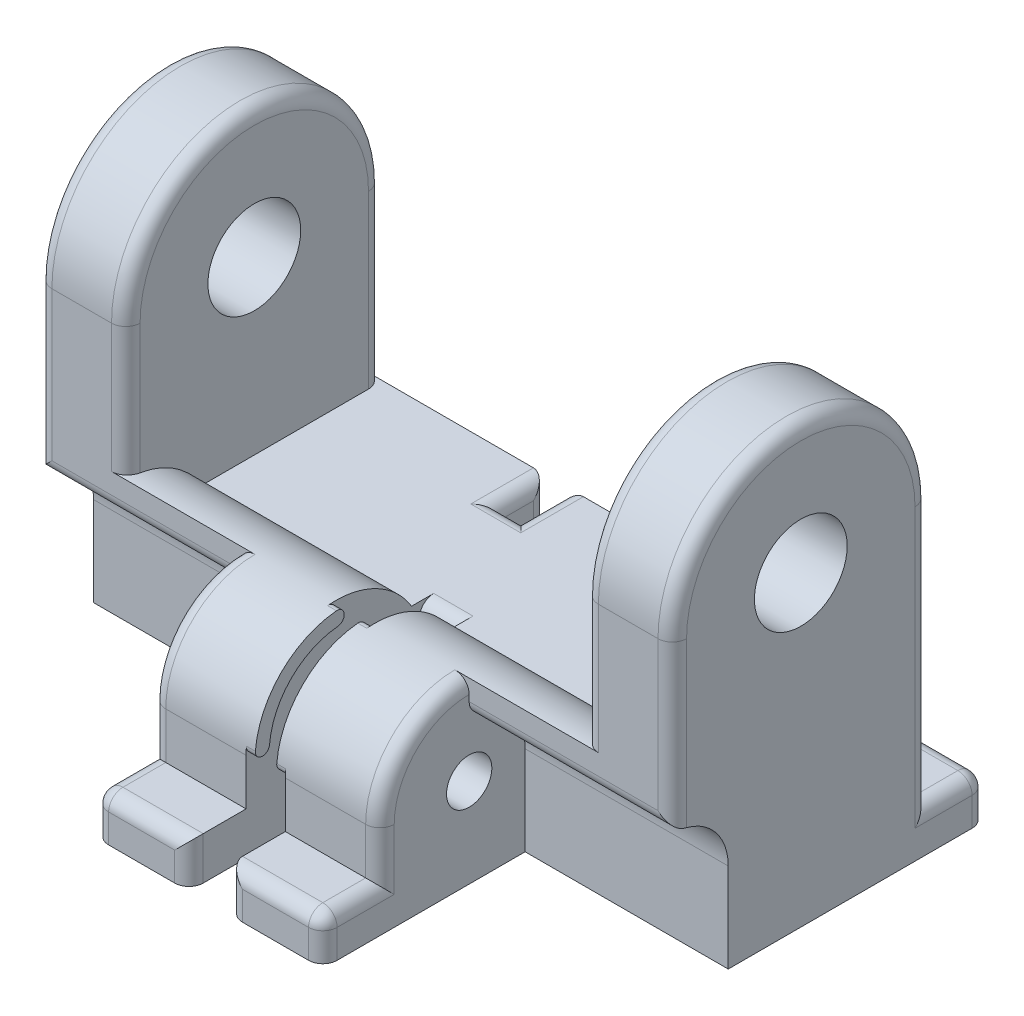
ISO-10303-21;
HEADER;
FILE_DESCRIPTION(('STEP AP214'),'2;1');
FILE_NAME('part.step','',(''),(''),'','','');
FILE_SCHEMA(('AUTOMOTIVE_DESIGN { 1 0 10303 214 1 1 1 1 }'));
ENDSEC;
DATA;
#1=APPLICATION_CONTEXT('core data for automotive mechanical design processes');
#2=APPLICATION_PROTOCOL_DEFINITION('international standard','automotive_design',2000,#1);
#3=PRODUCT_CONTEXT('',#1,'mechanical');
#4=PRODUCT('Part','Part','',(#3));
#5=PRODUCT_RELATED_PRODUCT_CATEGORY('part','',(#4));
#6=PRODUCT_DEFINITION_FORMATION('','',#4);
#7=PRODUCT_DEFINITION_CONTEXT('part definition',#1,'design');
#8=PRODUCT_DEFINITION('design','',#6,#7);
#9=PRODUCT_DEFINITION_SHAPE('','',#8);
#10=(LENGTH_UNIT() NAMED_UNIT(*) SI_UNIT(.MILLI.,.METRE.));
#11=(NAMED_UNIT(*) PLANE_ANGLE_UNIT() SI_UNIT($,.RADIAN.));
#12=(NAMED_UNIT(*) SI_UNIT($,.STERADIAN.) SOLID_ANGLE_UNIT());
#13=UNCERTAINTY_MEASURE_WITH_UNIT(LENGTH_MEASURE(1.E-05),#10,'distance_accuracy_value','');
#14=(GEOMETRIC_REPRESENTATION_CONTEXT(3) GLOBAL_UNCERTAINTY_ASSIGNED_CONTEXT((#13)) GLOBAL_UNIT_ASSIGNED_CONTEXT((#10,
#11,#12)) REPRESENTATION_CONTEXT('',''));
#15=CARTESIAN_POINT('',(0.,0.,0.));
#16=DIRECTION('',(0.,0.,1.));
#17=DIRECTION('',(1.,0.,0.));
#18=AXIS2_PLACEMENT_3D('',#15,#16,#17);
#19=CARTESIAN_POINT('',(22.225,21.5,-18.));
#20=DIRECTION('',(0.,0.,1.));
#21=DIRECTION('',(0.,-1.,0.));
#22=AXIS2_PLACEMENT_3D('',#19,#20,#21);
#23=PLANE('',#22);
#24=DIRECTION('',(-1.,0.,0.));
#25=VECTOR('',#24,1.);
#26=CARTESIAN_POINT('',(22.225,21.5,-18.));
#27=LINE('',#26,#25);
#28=CARTESIAN_POINT('',(-17.05,21.5,-18.));
#29=VERTEX_POINT('',#28);
#30=CARTESIAN_POINT('',(-21.225,21.5,-18.));
#31=VERTEX_POINT('',#30);
#32=EDGE_CURVE('E614',#29,#31,#27,.T.);
#33=ORIENTED_EDGE('',*,*,#32,.F.);
#34=DIRECTION('',(0.,1.,0.));
#35=VECTOR('',#34,1.);
#36=CARTESIAN_POINT('',(-17.05,9.5,-18.));
#37=LINE('',#36,#35);
#38=CARTESIAN_POINT('',(-17.05,9.5,-18.));
#39=VERTEX_POINT('',#38);
#40=EDGE_CURVE('E749',#29,#39,#37,.F.);
#41=ORIENTED_EDGE('',*,*,#40,.T.);
#42=DIRECTION('',(1.,0.,0.));
#43=VECTOR('',#42,1.);
#44=CARTESIAN_POINT('',(-15.875,9.5,-18.));
#45=LINE('',#44,#43);
#46=CARTESIAN_POINT('',(-5.5,9.5,-18.));
#47=VERTEX_POINT('',#46);
#48=EDGE_CURVE('E560',#39,#47,#45,.T.);
#49=ORIENTED_EDGE('',*,*,#48,.T.);
#50=DIRECTION('',(0.,1.,0.));
#51=VECTOR('',#50,1.);
#52=CARTESIAN_POINT('',(-5.5,6.,-18.));
#53=LINE('',#52,#51);
#54=CARTESIAN_POINT('',(-5.5,5.11251780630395,-18.));
#55=VERTEX_POINT('',#54);
#56=EDGE_CURVE('E745',#47,#55,#53,.F.);
#57=ORIENTED_EDGE('',*,*,#56,.T.);
#58=DIRECTION('',(1.,0.,0.));
#59=VECTOR('',#58,1.);
#60=CARTESIAN_POINT('',(-3.,5.11251780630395,-18.));
#61=LINE('',#60,#59);
#62=CARTESIAN_POINT('',(-2.,5.11251780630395,-18.));
#63=VERTEX_POINT('',#62);
#64=EDGE_CURVE('E742',#55,#63,#61,.T.);
#65=ORIENTED_EDGE('',*,*,#64,.T.);
#66=DIRECTION('',(0.,-1.,0.));
#67=VECTOR('',#66,1.);
#68=CARTESIAN_POINT('',(-2.,9.5,-18.));
#69=LINE('',#68,#67);
#70=CARTESIAN_POINT('',(-2.,9.5,-18.));
#71=VERTEX_POINT('',#70);
#72=EDGE_CURVE('E740',#63,#71,#69,.F.);
#73=ORIENTED_EDGE('',*,*,#72,.T.);
#74=CARTESIAN_POINT('',(17.05,9.5,-18.));
#75=VERTEX_POINT('',#74);
#76=EDGE_CURVE('E496',#71,#75,#45,.T.);
#77=ORIENTED_EDGE('',*,*,#76,.T.);
#78=DIRECTION('',(0.,1.,0.));
#79=VECTOR('',#78,1.);
#80=CARTESIAN_POINT('',(17.05,21.5,-18.));
#81=LINE('',#80,#79);
#82=CARTESIAN_POINT('',(17.05,21.5,-18.));
#83=VERTEX_POINT('',#82);
#84=EDGE_CURVE('E747',#75,#83,#81,.T.);
#85=ORIENTED_EDGE('',*,*,#84,.T.);
#86=CARTESIAN_POINT('',(21.225,21.5,-18.));
#87=VERTEX_POINT('',#86);
#88=EDGE_CURVE('E615',#87,#83,#27,.T.);
#89=ORIENTED_EDGE('',*,*,#88,.F.);
#90=DIRECTION('',(0.,1.,0.));
#91=VECTOR('',#90,1.);
#92=CARTESIAN_POINT('',(21.225,21.5,-18.));
#93=LINE('',#92,#91);
#94=CARTESIAN_POINT('',(21.225,3.,-18.));
#95=VERTEX_POINT('',#94);
#96=EDGE_CURVE('E736',#87,#95,#93,.F.);
#97=ORIENTED_EDGE('',*,*,#96,.T.);
#98=DIRECTION('',(-1.,0.,0.));
#99=VECTOR('',#98,1.);
#100=CARTESIAN_POINT('',(22.225,3.,-18.));
#101=LINE('',#100,#99);
#102=CARTESIAN_POINT('',(-21.225,3.,-18.));
#103=VERTEX_POINT('',#102);
#104=EDGE_CURVE('E618',#95,#103,#101,.T.);
#105=ORIENTED_EDGE('',*,*,#104,.T.);
#106=DIRECTION('',(0.,1.,0.));
#107=VECTOR('',#106,1.);
#108=CARTESIAN_POINT('',(-21.225,21.5,-18.));
#109=LINE('',#108,#107);
#110=EDGE_CURVE('E738',#103,#31,#109,.T.);
#111=ORIENTED_EDGE('',*,*,#110,.T.);
#112=EDGE_LOOP('',(#33,#41,#49,#57,#65,#73,#77,#85,#89,#97,#105,#111));
#113=FACE_BOUND('',#112,.T.);
#114=ADVANCED_FACE('F32',(#113),#23,.F.);
#115=CARTESIAN_POINT('',(-15.875,9.5,-5.33853912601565));
#116=DIRECTION('',(0.,-1.,0.));
#117=DIRECTION('',(0.,0.,-1.));
#118=AXIS2_PLACEMENT_3D('',#115,#116,#117);
#119=PLANE('',#118);
#120=DIRECTION('',(1.,0.,0.));
#121=VECTOR('',#120,1.);
#122=CARTESIAN_POINT('',(-4.5,9.5,-13.612517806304));
#123=LINE('',#122,#121);
#124=CARTESIAN_POINT('',(-2.,9.5,-13.612517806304));
#125=VERTEX_POINT('',#124);
#126=CARTESIAN_POINT('',(-5.5,9.5,-13.612517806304));
#127=VERTEX_POINT('',#126);
#128=EDGE_CURVE('E780',#125,#127,#123,.F.);
#129=ORIENTED_EDGE('',*,*,#128,.T.);
#130=DIRECTION('',(0.,0.,1.));
#131=VECTOR('',#130,1.);
#132=CARTESIAN_POINT('',(-5.5,9.5,-18.));
#133=LINE('',#132,#131);
#134=EDGE_CURVE('E782',#127,#47,#133,.F.);
#135=ORIENTED_EDGE('',*,*,#134,.T.);
#136=ORIENTED_EDGE('',*,*,#48,.F.);
#137=CARTESIAN_POINT('',(-17.05,9.5,-17.));
#138=DIRECTION('',(0.,-1.,0.));
#139=DIRECTION('',(0.,0.,-1.));
#140=AXIS2_PLACEMENT_3D('',#137,#138,#139);
#141=CIRCLE('',#140,1.);
#142=CARTESIAN_POINT('',(-16.05,9.5,-17.));
#143=VERTEX_POINT('',#142);
#144=EDGE_CURVE('E501',#39,#143,#141,.T.);
#145=ORIENTED_EDGE('',*,*,#144,.T.);
#146=DIRECTION('',(0.,0.,-1.));
#147=VECTOR('',#146,1.);
#148=CARTESIAN_POINT('',(-16.05,9.5,-5.33853912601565));
#149=LINE('',#148,#147);
#150=CARTESIAN_POINT('',(-16.05,9.5,-5.33853912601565));
#151=VERTEX_POINT('',#150);
#152=EDGE_CURVE('E482',#151,#143,#149,.T.);
#153=ORIENTED_EDGE('',*,*,#152,.F.);
#154=DIRECTION('',(1.,0.,0.));
#155=VECTOR('',#154,1.);
#156=CARTESIAN_POINT('',(-15.875,9.5,-5.33853912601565));
#157=LINE('',#156,#155);
#158=CARTESIAN_POINT('',(-1.375,9.5,-5.33853912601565));
#159=VERTEX_POINT('',#158);
#160=EDGE_CURVE('E491',#151,#159,#157,.T.);
#161=ORIENTED_EDGE('',*,*,#160,.T.);
#162=DIRECTION('',(0.,0.,-1.));
#163=VECTOR('',#162,1.);
#164=CARTESIAN_POINT('',(-1.375,9.5,0.));
#165=LINE('',#164,#163);
#166=CARTESIAN_POINT('',(-1.375,9.5,-6.89202437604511));
#167=VERTEX_POINT('',#166);
#168=EDGE_CURVE('E48',#159,#167,#165,.T.);
#169=ORIENTED_EDGE('',*,*,#168,.T.);
#170=DIRECTION('',(1.,0.,0.));
#171=VECTOR('',#170,1.);
#172=CARTESIAN_POINT('',(-15.875,9.5,-6.89202437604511));
#173=LINE('',#172,#171);
#174=CARTESIAN_POINT('',(1.375,9.5,-6.89202437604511));
#175=VERTEX_POINT('',#174);
#176=EDGE_CURVE('E773',#167,#175,#173,.T.);
#177=ORIENTED_EDGE('',*,*,#176,.T.);
#178=DIRECTION('',(0.,0.,1.));
#179=VECTOR('',#178,1.);
#180=CARTESIAN_POINT('',(1.375,9.5,-5.33853912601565));
#181=LINE('',#180,#179);
#182=CARTESIAN_POINT('',(1.375,9.5,-5.33853912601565));
#183=VERTEX_POINT('',#182);
#184=EDGE_CURVE('E776',#175,#183,#181,.T.);
#185=ORIENTED_EDGE('',*,*,#184,.T.);
#186=CARTESIAN_POINT('',(16.05,9.5,-5.33853912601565));
#187=VERTEX_POINT('',#186);
#188=EDGE_CURVE('E497',#183,#187,#157,.T.);
#189=ORIENTED_EDGE('',*,*,#188,.T.);
#190=DIRECTION('',(0.,0.,-1.));
#191=VECTOR('',#190,1.);
#192=CARTESIAN_POINT('',(16.05,9.5,-5.33853912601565));
#193=LINE('',#192,#191);
#194=CARTESIAN_POINT('',(16.05,9.5,-17.));
#195=VERTEX_POINT('',#194);
#196=EDGE_CURVE('E488',#187,#195,#193,.T.);
#197=ORIENTED_EDGE('',*,*,#196,.T.);
#198=CARTESIAN_POINT('',(17.05,9.5,-17.));
#199=DIRECTION('',(0.,-1.,0.));
#200=DIRECTION('',(0.,0.,-1.));
#201=AXIS2_PLACEMENT_3D('',#198,#199,#200);
#202=CIRCLE('',#201,1.);
#203=EDGE_CURVE('E1020',#195,#75,#202,.T.);
#204=ORIENTED_EDGE('',*,*,#203,.T.);
#205=ORIENTED_EDGE('',*,*,#76,.F.);
#206=DIRECTION('',(0.,0.,-1.));
#207=VECTOR('',#206,1.);
#208=CARTESIAN_POINT('',(-2.,9.5,-14.5));
#209=LINE('',#208,#207);
#210=EDGE_CURVE('E778',#71,#125,#209,.F.);
#211=ORIENTED_EDGE('',*,*,#210,.T.);
#212=EDGE_LOOP('',(#129,#135,#136,#145,#153,#161,#169,#177,#185,#189,#197,#204,#205,#211));
#213=FACE_BOUND('',#212,.T.);
#214=ADVANCED_FACE('F499',(#213),#119,.F.);
#215=CARTESIAN_POINT('',(22.225,6.25,0.));
#216=DIRECTION('',(-1.,0.,0.));
#217=DIRECTION('',(0.,0.,1.));
#218=AXIS2_PLACEMENT_3D('',#215,#216,#217);
#219=CYLINDRICAL_SURFACE('',#218,6.25);
#220=DIRECTION('',(-1.,0.,0.));
#221=VECTOR('',#220,1.);
#222=CARTESIAN_POINT('',(22.225,6.25,6.25));
#223=LINE('',#222,#221);
#224=CARTESIAN_POINT('',(7.,6.25,6.25));
#225=VERTEX_POINT('',#224);
#226=CARTESIAN_POINT('',(1.375,6.25,6.25));
#227=VERTEX_POINT('',#226);
#228=EDGE_CURVE('E632',#225,#227,#223,.T.);
#229=ORIENTED_EDGE('',*,*,#228,.F.);
#230=CARTESIAN_POINT('',(7.,6.25,0.));
#231=DIRECTION('',(1.,0.,0.));
#232=DIRECTION('',(0.,0.,-1.));
#233=AXIS2_PLACEMENT_3D('',#230,#231,#232);
#234=CIRCLE('',#233,6.25);
#235=CARTESIAN_POINT('',(7.,12.5,0.));
#236=VERTEX_POINT('',#235);
#237=EDGE_CURVE('E801',#225,#236,#234,.F.);
#238=ORIENTED_EDGE('',*,*,#237,.T.);
#239=DIRECTION('',(1.,0.,0.));
#240=VECTOR('',#239,1.);
#241=CARTESIAN_POINT('',(8.,12.5,0.));
#242=LINE('',#241,#240);
#243=CARTESIAN_POINT('',(17.05,12.5,0.));
#244=VERTEX_POINT('',#243);
#245=EDGE_CURVE('E558',#236,#244,#242,.T.);
#246=ORIENTED_EDGE('',*,*,#245,.T.);
#247=CARTESIAN_POINT('',(17.05,12.5,0.));
#248=CARTESIAN_POINT('',(17.0218723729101,12.4999989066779,-1.88012767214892E-07));
#249=CARTESIAN_POINT('',(16.9937582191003,12.500000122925,-0.00118748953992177));
#250=CARTESIAN_POINT('',(16.9377309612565,12.4999978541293,-0.00592412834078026));
#251=CARTESIAN_POINT('',(16.9098178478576,12.4999943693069,-0.00947335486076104));
#252=CARTESIAN_POINT('',(16.8267262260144,12.4999629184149,-0.0236306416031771));
#253=CARTESIAN_POINT('',(16.7721040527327,12.4999140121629,-0.0377483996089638));
#254=CARTESIAN_POINT('',(16.6660055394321,12.4995779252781,-0.0749516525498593));
#255=CARTESIAN_POINT('',(16.614530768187,12.4992906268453,-0.0980415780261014));
#256=CARTESIAN_POINT('',(16.5161919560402,12.4981976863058,-0.152529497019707));
#257=CARTESIAN_POINT('',(16.4693271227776,12.4973921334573,-0.183926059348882));
#258=CARTESIAN_POINT('',(16.3815931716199,12.4949312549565,-0.254088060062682));
#259=CARTESIAN_POINT('',(16.3407176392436,12.4932768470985,-0.292845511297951));
#260=CARTESIAN_POINT('',(16.266062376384,12.4887823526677,-0.3766305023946));
#261=CARTESIAN_POINT('',(16.2322832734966,12.4859421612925,-0.421658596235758));
#262=CARTESIAN_POINT('',(16.1729107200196,12.4788069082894,-0.516440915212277));
#263=CARTESIAN_POINT('',(16.1472826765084,12.4745181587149,-0.566173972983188));
#264=CARTESIAN_POINT('',(16.104708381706,12.4642997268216,-0.669062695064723));
#265=CARTESIAN_POINT('',(16.0877585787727,12.4583707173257,-0.722216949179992));
#266=CARTESIAN_POINT('',(16.0669020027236,12.4469998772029,-0.813061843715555));
#267=CARTESIAN_POINT('',(16.0605584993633,12.4420072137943,-0.850269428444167));
#268=CARTESIAN_POINT('',(16.0521075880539,12.4312873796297,-0.924999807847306));
#269=CARTESIAN_POINT('',(16.0499937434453,12.4255613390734,-0.962522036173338));
#270=CARTESIAN_POINT('',(16.05,12.4194813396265,-1.));
#271=B_SPLINE_CURVE_WITH_KNOTS('',3,(#247,#248,#249,#250,#251,#252,#253,#254,#255,#256,#257,
#258,#259,#260,#261,#262,#263,#264,#265,#266,#267,#268,#269,#270),.UNSPECIFIED.,.F.,.F.,(4,2,2,
2,2,2,2,2,2,2,2,4),(0.,0.084331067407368,0.168658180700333,0.337041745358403,0.505508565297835,
0.673946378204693,0.842202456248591,1.0104734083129,1.17802038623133,1.34549873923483,
1.45948875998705,1.57330517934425),.UNSPECIFIED.);
#272=CARTESIAN_POINT('',(16.05,12.4194813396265,-1.));
#273=VERTEX_POINT('',#272);
#274=EDGE_CURVE('E1014',#244,#273,#271,.T.);
#275=ORIENTED_EDGE('',*,*,#274,.T.);
#276=CARTESIAN_POINT('',(16.05,6.25,0.));
#277=DIRECTION('',(-1.,0.,0.));
#278=DIRECTION('',(0.,0.,-1.));
#279=AXIS2_PLACEMENT_3D('',#276,#277,#278);
#280=CIRCLE('',#279,6.25);
#281=EDGE_CURVE('E509',#273,#187,#280,.T.);
#282=ORIENTED_EDGE('',*,*,#281,.T.);
#283=ORIENTED_EDGE('',*,*,#188,.F.);
#284=CARTESIAN_POINT('',(1.375,6.25,0.));
#285=DIRECTION('',(1.,0.,0.));
#286=DIRECTION('',(0.,0.,1.));
#287=AXIS2_PLACEMENT_3D('',#284,#285,#286);
#288=CIRCLE('',#287,6.25);
#289=CARTESIAN_POINT('',(1.375,12.4763256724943,0.543478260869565));
#290=VERTEX_POINT('',#289);
#291=EDGE_CURVE('E588',#183,#290,#288,.T.);
#292=ORIENTED_EDGE('',*,*,#291,.T.);
#293=DIRECTION('',(-1.,0.,0.));
#294=VECTOR('',#293,1.);
#295=CARTESIAN_POINT('',(22.225,12.4763256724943,0.543478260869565));
#296=LINE('',#295,#294);
#297=CARTESIAN_POINT('',(0.750000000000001,12.4763256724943,0.543478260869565));
#298=VERTEX_POINT('',#297);
#299=EDGE_CURVE('E666',#290,#298,#296,.T.);
#300=ORIENTED_EDGE('',*,*,#299,.T.);
#301=CARTESIAN_POINT('',(0.750000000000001,6.25,0.));
#302=DIRECTION('',(1.,0.,0.));
#303=DIRECTION('',(0.,0.,-1.));
#304=AXIS2_PLACEMENT_3D('',#301,#302,#303);
#305=CIRCLE('',#304,6.25);
#306=CARTESIAN_POINT('',(0.750000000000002,6.79347826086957,6.22632567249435));
#307=VERTEX_POINT('',#306);
#308=EDGE_CURVE('E1381',#298,#307,#305,.T.);
#309=ORIENTED_EDGE('',*,*,#308,.T.);
#310=DIRECTION('',(-1.,0.,0.));
#311=VECTOR('',#310,1.);
#312=CARTESIAN_POINT('',(22.225,6.79347826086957,6.22632567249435));
#313=LINE('',#312,#311);
#314=CARTESIAN_POINT('',(1.375,6.79347826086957,6.22632567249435));
#315=VERTEX_POINT('',#314);
#316=EDGE_CURVE('E663',#307,#315,#313,.F.);
#317=ORIENTED_EDGE('',*,*,#316,.T.);
#318=CARTESIAN_POINT('',(1.375,6.25,0.));
#319=DIRECTION('',(1.,0.,0.));
#320=DIRECTION('',(0.,0.,-1.));
#321=AXIS2_PLACEMENT_3D('',#318,#319,#320);
#322=CIRCLE('',#321,6.25);
#323=EDGE_CURVE('E660',#315,#227,#322,.T.);
#324=ORIENTED_EDGE('',*,*,#323,.T.);
#325=EDGE_LOOP('',(#229,#238,#246,#275,#282,#283,#292,#300,#309,#317,#324));
#326=FACE_BOUND('',#325,.T.);
#327=ADVANCED_FACE('F924',(#326),#219,.T.);
#328=CARTESIAN_POINT('',(10.2138347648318,6.25,0.));
#329=DIRECTION('',(-1.,0.,0.));
#330=DIRECTION('',(0.,0.,1.));
#331=AXIS2_PLACEMENT_3D('',#328,#329,#330);
#332=CYLINDRICAL_SURFACE('',#331,5.25);
#333=CARTESIAN_POINT('',(0.749999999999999,6.25,0.));
#334=DIRECTION('',(1.,0.,0.));
#335=DIRECTION('',(0.,0.,-1.));
#336=AXIS2_PLACEMENT_3D('',#333,#334,#335);
#337=CIRCLE('',#336,5.25);
#338=CARTESIAN_POINT('',(0.75,6.70652173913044,5.23011356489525));
#339=VERTEX_POINT('',#338);
#340=CARTESIAN_POINT('',(0.749999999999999,11.4801135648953,0.456521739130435));
#341=VERTEX_POINT('',#340);
#342=EDGE_CURVE('E1376',#339,#341,#337,.F.);
#343=ORIENTED_EDGE('',*,*,#342,.T.);
#344=DIRECTION('',(-1.,0.,0.));
#345=VECTOR('',#344,1.);
#346=CARTESIAN_POINT('',(10.2138347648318,11.4801135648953,0.456521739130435));
#347=LINE('',#346,#345);
#348=CARTESIAN_POINT('',(1.375,11.4801135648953,0.456521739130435));
#349=VERTEX_POINT('',#348);
#350=EDGE_CURVE('E657',#341,#349,#347,.F.);
#351=ORIENTED_EDGE('',*,*,#350,.T.);
#352=CARTESIAN_POINT('',(1.375,6.25,0.));
#353=DIRECTION('',(1.,0.,0.));
#354=DIRECTION('',(0.,0.,-1.));
#355=AXIS2_PLACEMENT_3D('',#352,#353,#354);
#356=CIRCLE('',#355,5.25);
#357=CARTESIAN_POINT('',(1.375,6.70652173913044,5.23011356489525));
#358=VERTEX_POINT('',#357);
#359=EDGE_CURVE('E511',#358,#349,#356,.F.);
#360=ORIENTED_EDGE('',*,*,#359,.F.);
#361=DIRECTION('',(-1.,0.,0.));
#362=VECTOR('',#361,1.);
#363=CARTESIAN_POINT('',(10.2138347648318,6.70652173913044,5.23011356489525));
#364=LINE('',#363,#362);
#365=EDGE_CURVE('E654',#358,#339,#364,.T.);
#366=ORIENTED_EDGE('',*,*,#365,.T.);
#367=EDGE_LOOP('',(#343,#351,#360,#366));
#368=FACE_BOUND('',#367,.T.);
#369=ADVANCED_FACE('F929',(#368),#332,.F.);
#370=CARTESIAN_POINT('',(-1.375,6.25,0.));
#371=DIRECTION('',(1.,0.,0.));
#372=DIRECTION('',(0.,0.,-1.));
#373=AXIS2_PLACEMENT_3D('',#370,#371,#372);
#374=PLANE('',#373);
#375=CARTESIAN_POINT('',(-1.375,6.25,0.));
#376=DIRECTION('',(1.,0.,0.));
#377=DIRECTION('',(0.,0.,-1.));
#378=AXIS2_PLACEMENT_3D('',#375,#376,#377);
#379=CIRCLE('',#378,1.5875);
#380=CARTESIAN_POINT('',(-1.375,6.25,-1.5875));
#381=VERTEX_POINT('',#380);
#382=EDGE_CURVE('E604',#381,#381,#379,.T.);
#383=ORIENTED_EDGE('',*,*,#382,.F.);
#384=EDGE_LOOP('',(#383));
#385=FACE_BOUND('',#384,.T.);
#386=DIRECTION('',(0.,0.,1.));
#387=VECTOR('',#386,1.);
#388=CARTESIAN_POINT('',(-1.375,3.,6.25));
#389=LINE('',#388,#387);
#390=CARTESIAN_POINT('',(-1.375,3.,6.25));
#391=VERTEX_POINT('',#390);
#392=CARTESIAN_POINT('',(-1.375,3.,9.25));
#393=VERTEX_POINT('',#392);
#394=EDGE_CURVE('E569',#391,#393,#389,.T.);
#395=ORIENTED_EDGE('',*,*,#394,.T.);
#396=DIRECTION('',(0.,-1.,0.));
#397=VECTOR('',#396,1.);
#398=CARTESIAN_POINT('',(-1.375,0.,9.25));
#399=LINE('',#398,#397);
#400=CARTESIAN_POINT('',(-1.375,0.,9.25));
#401=VERTEX_POINT('',#400);
#402=EDGE_CURVE('E1240',#393,#401,#399,.T.);
#403=ORIENTED_EDGE('',*,*,#402,.T.);
#404=DIRECTION('',(0.,0.,-1.));
#405=VECTOR('',#404,1.);
#406=CARTESIAN_POINT('',(-1.375,0.,10.25));
#407=LINE('',#406,#405);
#408=CARTESIAN_POINT('',(-1.375,0.,-6.25));
#409=VERTEX_POINT('',#408);
#410=EDGE_CURVE('E572',#401,#409,#407,.T.);
#411=ORIENTED_EDGE('',*,*,#410,.T.);
#412=DIRECTION('',(0.,1.,0.));
#413=VECTOR('',#412,1.);
#414=CARTESIAN_POINT('',(-1.375,6.25,-6.25));
#415=LINE('',#414,#413);
#416=CARTESIAN_POINT('',(-1.375,6.25,-6.25));
#417=VERTEX_POINT('',#416);
#418=EDGE_CURVE('E574',#409,#417,#415,.T.);
#419=ORIENTED_EDGE('',*,*,#418,.T.);
#420=CARTESIAN_POINT('',(-1.375,6.25,0.));
#421=DIRECTION('',(1.,0.,0.));
#422=DIRECTION('',(0.,0.,-1.));
#423=AXIS2_PLACEMENT_3D('',#420,#421,#422);
#424=CIRCLE('',#423,6.25);
#425=CARTESIAN_POINT('',(-1.375,8.18965517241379,-5.94140032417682));
#426=VERTEX_POINT('',#425);
#427=EDGE_CURVE('E564',#417,#426,#424,.T.);
#428=ORIENTED_EDGE('',*,*,#427,.T.);
#429=CARTESIAN_POINT('',(-1.375,8.5,-6.89202437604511));
#430=DIRECTION('',(1.,0.,0.));
#431=DIRECTION('',(0.,0.,-1.));
#432=AXIS2_PLACEMENT_3D('',#429,#430,#431);
#433=CIRCLE('',#432,1.);
#434=EDGE_CURVE('E11',#426,#167,#433,.F.);
#435=ORIENTED_EDGE('',*,*,#434,.T.);
#436=ORIENTED_EDGE('',*,*,#168,.F.);
#437=CARTESIAN_POINT('',(-1.375,12.4763256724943,0.543478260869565));
#438=VERTEX_POINT('',#437);
#439=EDGE_CURVE('E494',#159,#438,#424,.T.);
#440=ORIENTED_EDGE('',*,*,#439,.T.);
#441=CARTESIAN_POINT('',(-1.375,11.9782196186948,0.5));
#442=DIRECTION('',(1.,0.,0.));
#443=DIRECTION('',(0.,0.,-1.));
#444=AXIS2_PLACEMENT_3D('',#441,#442,#443);
#445=CIRCLE('',#444,0.5);
#446=CARTESIAN_POINT('',(-1.375,11.9782196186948,0.));
#447=VERTEX_POINT('',#446);
#448=EDGE_CURVE('E696',#438,#447,#445,.F.);
#449=ORIENTED_EDGE('',*,*,#448,.T.);
#450=CARTESIAN_POINT('',(-1.375,11.9782196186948,0.5));
#451=DIRECTION('',(1.,0.,0.));
#452=DIRECTION('',(0.,0.,-1.));
#453=AXIS2_PLACEMENT_3D('',#450,#451,#452);
#454=CIRCLE('',#453,0.5);
#455=CARTESIAN_POINT('',(-1.375,11.4801135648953,0.456521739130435));
#456=VERTEX_POINT('',#455);
#457=EDGE_CURVE('E694',#447,#456,#454,.F.);
#458=ORIENTED_EDGE('',*,*,#457,.T.);
#459=CARTESIAN_POINT('',(-1.375,6.25,0.));
#460=DIRECTION('',(1.,0.,0.));
#461=DIRECTION('',(0.,0.,-1.));
#462=AXIS2_PLACEMENT_3D('',#459,#460,#461);
#463=CIRCLE('',#462,5.25);
#464=CARTESIAN_POINT('',(-1.375,6.70652173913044,5.23011356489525));
#465=VERTEX_POINT('',#464);
#466=EDGE_CURVE('E1384',#456,#465,#463,.T.);
#467=ORIENTED_EDGE('',*,*,#466,.T.);
#468=CARTESIAN_POINT('',(-1.375,6.75,5.7282196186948));
#469=DIRECTION('',(1.,0.,0.));
#470=DIRECTION('',(0.,0.,-1.));
#471=AXIS2_PLACEMENT_3D('',#468,#469,#470);
#472=CIRCLE('',#471,0.5);
#473=CARTESIAN_POINT('',(-1.375,6.25,5.7282196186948));
#474=VERTEX_POINT('',#473);
#475=EDGE_CURVE('E702',#465,#474,#472,.F.);
#476=ORIENTED_EDGE('',*,*,#475,.T.);
#477=CARTESIAN_POINT('',(-1.375,6.75,5.7282196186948));
#478=DIRECTION('',(1.,0.,0.));
#479=DIRECTION('',(0.,0.,-1.));
#480=AXIS2_PLACEMENT_3D('',#477,#478,#479);
#481=CIRCLE('',#480,0.5);
#482=CARTESIAN_POINT('',(-1.375,6.79347826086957,6.22632567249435));
#483=VERTEX_POINT('',#482);
#484=EDGE_CURVE('E704',#474,#483,#481,.F.);
#485=ORIENTED_EDGE('',*,*,#484,.T.);
#486=CARTESIAN_POINT('',(-1.375,6.25,0.));
#487=DIRECTION('',(1.,0.,0.));
#488=DIRECTION('',(0.,0.,-1.));
#489=AXIS2_PLACEMENT_3D('',#486,#487,#488);
#490=CIRCLE('',#489,6.25);
#491=CARTESIAN_POINT('',(-1.375,6.25,6.25));
#492=VERTEX_POINT('',#491);
#493=EDGE_CURVE('E684',#492,#483,#490,.F.);
#494=ORIENTED_EDGE('',*,*,#493,.F.);
#495=DIRECTION('',(0.,-1.,0.));
#496=VECTOR('',#495,1.);
#497=CARTESIAN_POINT('',(-1.375,6.25,6.25));
#498=LINE('',#497,#496);
#499=EDGE_CURVE('E567',#492,#391,#498,.T.);
#500=ORIENTED_EDGE('',*,*,#499,.T.);
#501=EDGE_LOOP('',(#395,#403,#411,#419,#428,#435,#436,#440,#449,#458,#467,#476,#485,#494,#500));
#502=FACE_BOUND('',#501,.T.);
#503=ADVANCED_FACE('F925',(#385,#502),#374,.T.);
#504=CARTESIAN_POINT('',(1.375,6.25,0.));
#505=DIRECTION('',(1.,0.,0.));
#506=DIRECTION('',(0.,0.,-1.));
#507=AXIS2_PLACEMENT_3D('',#504,#505,#506);
#508=PLANE('',#507);
#509=CARTESIAN_POINT('',(1.375,6.25,0.));
#510=DIRECTION('',(1.,0.,0.));
#511=DIRECTION('',(0.,0.,-1.));
#512=AXIS2_PLACEMENT_3D('',#509,#510,#511);
#513=CIRCLE('',#512,1.5875);
#514=CARTESIAN_POINT('',(1.375,6.25,-1.5875));
#515=VERTEX_POINT('',#514);
#516=EDGE_CURVE('E594',#515,#515,#513,.T.);
#517=ORIENTED_EDGE('',*,*,#516,.T.);
#518=EDGE_LOOP('',(#517));
#519=FACE_BOUND('',#518,.T.);
#520=DIRECTION('',(0.,0.,-1.));
#521=VECTOR('',#520,1.);
#522=CARTESIAN_POINT('',(1.375,0.,10.25));
#523=LINE('',#522,#521);
#524=CARTESIAN_POINT('',(1.375,0.,9.25));
#525=VERTEX_POINT('',#524);
#526=CARTESIAN_POINT('',(1.375,0.,-6.25));
#527=VERTEX_POINT('',#526);
#528=EDGE_CURVE('E583',#525,#527,#523,.T.);
#529=ORIENTED_EDGE('',*,*,#528,.F.);
#530=DIRECTION('',(0.,-1.,0.));
#531=VECTOR('',#530,1.);
#532=CARTESIAN_POINT('',(1.375,6.25,9.25));
#533=LINE('',#532,#531);
#534=CARTESIAN_POINT('',(1.375,3.,9.25));
#535=VERTEX_POINT('',#534);
#536=EDGE_CURVE('E1244',#525,#535,#533,.F.);
#537=ORIENTED_EDGE('',*,*,#536,.T.);
#538=DIRECTION('',(0.,0.,1.));
#539=VECTOR('',#538,1.);
#540=CARTESIAN_POINT('',(1.375,3.,6.25));
#541=LINE('',#540,#539);
#542=CARTESIAN_POINT('',(1.375,3.,6.25));
#543=VERTEX_POINT('',#542);
#544=EDGE_CURVE('E580',#543,#535,#541,.T.);
#545=ORIENTED_EDGE('',*,*,#544,.F.);
#546=DIRECTION('',(0.,-1.,0.));
#547=VECTOR('',#546,1.);
#548=CARTESIAN_POINT('',(1.375,6.25,6.25));
#549=LINE('',#548,#547);
#550=EDGE_CURVE('E562',#227,#543,#549,.T.);
#551=ORIENTED_EDGE('',*,*,#550,.F.);
#552=ORIENTED_EDGE('',*,*,#323,.F.);
#553=CARTESIAN_POINT('',(1.375,6.75,5.7282196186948));
#554=DIRECTION('',(1.,0.,0.));
#555=DIRECTION('',(0.,0.,-1.));
#556=AXIS2_PLACEMENT_3D('',#553,#554,#555);
#557=CIRCLE('',#556,0.5);
#558=CARTESIAN_POINT('',(1.375,6.25,5.7282196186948));
#559=VERTEX_POINT('',#558);
#560=EDGE_CURVE('E700',#315,#559,#557,.T.);
#561=ORIENTED_EDGE('',*,*,#560,.T.);
#562=CARTESIAN_POINT('',(1.375,6.75,5.7282196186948));
#563=DIRECTION('',(1.,0.,0.));
#564=DIRECTION('',(0.,0.,-1.));
#565=AXIS2_PLACEMENT_3D('',#562,#563,#564);
#566=CIRCLE('',#565,0.5);
#567=EDGE_CURVE('E698',#559,#358,#566,.T.);
#568=ORIENTED_EDGE('',*,*,#567,.T.);
#569=ORIENTED_EDGE('',*,*,#359,.T.);
#570=CARTESIAN_POINT('',(1.375,11.9782196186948,0.5));
#571=DIRECTION('',(1.,0.,0.));
#572=DIRECTION('',(0.,0.,-1.));
#573=AXIS2_PLACEMENT_3D('',#570,#571,#572);
#574=CIRCLE('',#573,0.5);
#575=CARTESIAN_POINT('',(1.375,11.9782196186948,0.));
#576=VERTEX_POINT('',#575);
#577=EDGE_CURVE('E689',#349,#576,#574,.T.);
#578=ORIENTED_EDGE('',*,*,#577,.T.);
#579=CARTESIAN_POINT('',(1.375,11.9782196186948,0.5));
#580=DIRECTION('',(1.,0.,0.));
#581=DIRECTION('',(0.,0.,-1.));
#582=AXIS2_PLACEMENT_3D('',#579,#580,#581);
#583=CIRCLE('',#582,0.5);
#584=EDGE_CURVE('E691',#576,#290,#583,.T.);
#585=ORIENTED_EDGE('',*,*,#584,.T.);
#586=ORIENTED_EDGE('',*,*,#291,.F.);
#587=ORIENTED_EDGE('',*,*,#184,.F.);
#588=CARTESIAN_POINT('',(1.375,8.5,-6.89202437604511));
#589=DIRECTION('',(1.,0.,0.));
#590=DIRECTION('',(0.,0.,-1.));
#591=AXIS2_PLACEMENT_3D('',#588,#589,#590);
#592=CIRCLE('',#591,1.);
#593=CARTESIAN_POINT('',(1.375,8.18965517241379,-5.94140032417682));
#594=VERTEX_POINT('',#593);
#595=EDGE_CURVE('E41',#175,#594,#592,.T.);
#596=ORIENTED_EDGE('',*,*,#595,.T.);
#597=CARTESIAN_POINT('',(1.375,6.25,-6.25));
#598=VERTEX_POINT('',#597);
#599=EDGE_CURVE('E589',#598,#594,#288,.T.);
#600=ORIENTED_EDGE('',*,*,#599,.F.);
#601=DIRECTION('',(0.,1.,0.));
#602=VECTOR('',#601,1.);
#603=CARTESIAN_POINT('',(1.375,6.25,-6.25));
#604=LINE('',#603,#602);
#605=EDGE_CURVE('E585',#527,#598,#604,.T.);
#606=ORIENTED_EDGE('',*,*,#605,.F.);
#607=EDGE_LOOP('',(#529,#537,#545,#551,#552,#561,#568,#569,#578,#585,#586,#587,#596,#600,#606));
#608=FACE_BOUND('',#607,.T.);
#609=ADVANCED_FACE('F928',(#519,#608),#508,.F.);
#610=CARTESIAN_POINT('',(22.225,21.5,-9.));
#611=DIRECTION('',(-1.,0.,0.));
#612=DIRECTION('',(0.,0.,1.));
#613=AXIS2_PLACEMENT_3D('',#610,#611,#612);
#614=CYLINDRICAL_SURFACE('',#613,9.);
#615=DIRECTION('',(-1.,0.,0.));
#616=VECTOR('',#615,1.);
#617=CARTESIAN_POINT('',(22.225,21.5,0.));
#618=LINE('',#617,#616);
#619=CARTESIAN_POINT('',(-17.05,21.5,0.));
#620=VERTEX_POINT('',#619);
#621=CARTESIAN_POINT('',(-21.225,21.5,0.));
#622=VERTEX_POINT('',#621);
#623=EDGE_CURVE('E608',#620,#622,#618,.T.);
#624=ORIENTED_EDGE('',*,*,#623,.F.);
#625=CARTESIAN_POINT('',(-17.05,21.5,-9.));
#626=DIRECTION('',(1.,0.,0.));
#627=DIRECTION('',(0.,0.,-1.));
#628=AXIS2_PLACEMENT_3D('',#625,#626,#627);
#629=CIRCLE('',#628,9.);
#630=EDGE_CURVE('E734',#620,#29,#629,.F.);
#631=ORIENTED_EDGE('',*,*,#630,.T.);
#632=ORIENTED_EDGE('',*,*,#32,.T.);
#633=CARTESIAN_POINT('',(-21.225,21.5,-9.));
#634=DIRECTION('',(-1.,0.,0.));
#635=DIRECTION('',(0.,0.,1.));
#636=AXIS2_PLACEMENT_3D('',#633,#634,#635);
#637=CIRCLE('',#636,9.);
#638=EDGE_CURVE('E732',#31,#622,#637,.F.);
#639=ORIENTED_EDGE('',*,*,#638,.T.);
#640=EDGE_LOOP('',(#624,#631,#632,#639));
#641=FACE_BOUND('',#640,.T.);
#642=ADVANCED_FACE('F933',(#641),#614,.T.);
#643=CARTESIAN_POINT('',(22.225,21.5,-9.));
#644=DIRECTION('',(-1.,0.,0.));
#645=DIRECTION('',(0.,0.,1.));
#646=AXIS2_PLACEMENT_3D('',#643,#644,#645);
#647=CYLINDRICAL_SURFACE('',#646,3.25000000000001);
#648=CARTESIAN_POINT('',(-22.225,21.5,-9.));
#649=DIRECTION('',(1.,0.,0.));
#650=DIRECTION('',(0.,0.,-1.));
#651=AXIS2_PLACEMENT_3D('',#648,#649,#650);
#652=CIRCLE('',#651,3.25000000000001);
#653=CARTESIAN_POINT('',(-22.225,21.5,-12.25));
#654=VERTEX_POINT('',#653);
#655=EDGE_CURVE('E601',#654,#654,#652,.T.);
#656=ORIENTED_EDGE('',*,*,#655,.F.);
#657=EDGE_LOOP('',(#656));
#658=FACE_BOUND('',#657,.T.);
#659=CARTESIAN_POINT('',(-16.05,21.5,-9.));
#660=DIRECTION('',(1.,0.,0.));
#661=DIRECTION('',(0.,0.,-1.));
#662=AXIS2_PLACEMENT_3D('',#659,#660,#661);
#663=CIRCLE('',#662,3.25000000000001);
#664=CARTESIAN_POINT('',(-16.05,21.5,-12.25));
#665=VERTEX_POINT('',#664);
#666=EDGE_CURVE('E505',#665,#665,#663,.T.);
#667=ORIENTED_EDGE('',*,*,#666,.T.);
#668=EDGE_LOOP('',(#667));
#669=FACE_BOUND('',#668,.T.);
#670=ADVANCED_FACE('F947',(#658,#669),#647,.F.);
#671=CARTESIAN_POINT('',(22.225,0.,10.25));
#672=DIRECTION('',(0.,1.,0.));
#673=DIRECTION('',(0.,0.,1.));
#674=AXIS2_PLACEMENT_3D('',#671,#672,#673);
#675=PLANE('',#674);
#676=DIRECTION('',(-1.,0.,0.));
#677=VECTOR('',#676,1.);
#678=CARTESIAN_POINT('',(22.225,0.,-22.));
#679=LINE('',#678,#677);
#680=CARTESIAN_POINT('',(21.225,0.,-22.));
#681=VERTEX_POINT('',#680);
#682=CARTESIAN_POINT('',(-21.225,0.,-22.));
#683=VERTEX_POINT('',#682);
#684=EDGE_CURVE('E621',#681,#683,#679,.T.);
#685=ORIENTED_EDGE('',*,*,#684,.F.);
#686=CARTESIAN_POINT('',(21.225,0.,-21.));
#687=DIRECTION('',(0.,1.,0.));
#688=DIRECTION('',(0.,0.,1.));
#689=AXIS2_PLACEMENT_3D('',#686,#687,#688);
#690=CIRCLE('',#689,1.);
#691=CARTESIAN_POINT('',(22.225,0.,-21.));
#692=VERTEX_POINT('',#691);
#693=EDGE_CURVE('E1521',#681,#692,#690,.F.);
#694=ORIENTED_EDGE('',*,*,#693,.T.);
#695=DIRECTION('',(0.,0.,-1.));
#696=VECTOR('',#695,1.);
#697=CARTESIAN_POINT('',(22.225,0.,10.25));
#698=LINE('',#697,#696);
#699=CARTESIAN_POINT('',(22.225,0.,-3.91875));
#700=VERTEX_POINT('',#699);
#701=EDGE_CURVE('E605',#700,#692,#698,.T.);
#702=ORIENTED_EDGE('',*,*,#701,.F.);
#703=DIRECTION('',(-1.,0.,0.));
#704=VECTOR('',#703,1.);
#705=CARTESIAN_POINT('',(35.0636090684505,0.,-3.91875));
#706=LINE('',#705,#704);
#707=CARTESIAN_POINT('',(8.,0.,-3.91875));
#708=VERTEX_POINT('',#707);
#709=EDGE_CURVE('E541',#700,#708,#706,.T.);
#710=ORIENTED_EDGE('',*,*,#709,.T.);
#711=DIRECTION('',(0.,0.,-1.));
#712=VECTOR('',#711,1.);
#713=CARTESIAN_POINT('',(8.,0.,0.));
#714=LINE('',#713,#712);
#715=CARTESIAN_POINT('',(8.,0.,9.25));
#716=VERTEX_POINT('',#715);
#717=EDGE_CURVE('E553',#716,#708,#714,.T.);
#718=ORIENTED_EDGE('',*,*,#717,.F.);
#719=CARTESIAN_POINT('',(7.,0.,9.25));
#720=DIRECTION('',(0.,1.,0.));
#721=DIRECTION('',(0.,0.,1.));
#722=AXIS2_PLACEMENT_3D('',#719,#720,#721);
#723=CIRCLE('',#722,1.);
#724=CARTESIAN_POINT('',(7.,0.,10.25));
#725=VERTEX_POINT('',#724);
#726=EDGE_CURVE('E1527',#716,#725,#723,.F.);
#727=ORIENTED_EDGE('',*,*,#726,.T.);
#728=DIRECTION('',(-1.,0.,0.));
#729=VECTOR('',#728,1.);
#730=CARTESIAN_POINT('',(22.225,0.,10.25));
#731=LINE('',#730,#729);
#732=CARTESIAN_POINT('',(2.375,0.,10.25));
#733=VERTEX_POINT('',#732);
#734=EDGE_CURVE('E627',#725,#733,#731,.T.);
#735=ORIENTED_EDGE('',*,*,#734,.T.);
#736=CARTESIAN_POINT('',(2.375,0.,9.25));
#737=DIRECTION('',(0.,1.,0.));
#738=DIRECTION('',(0.,0.,1.));
#739=AXIS2_PLACEMENT_3D('',#736,#737,#738);
#740=CIRCLE('',#739,1.);
#741=EDGE_CURVE('E1327',#733,#525,#740,.F.);
#742=ORIENTED_EDGE('',*,*,#741,.T.);
#743=ORIENTED_EDGE('',*,*,#528,.T.);
#744=DIRECTION('',(1.,0.,0.));
#745=VECTOR('',#744,1.);
#746=CARTESIAN_POINT('',(-1.375,0.,-6.25));
#747=LINE('',#746,#745);
#748=EDGE_CURVE('E577',#409,#527,#747,.T.);
#749=ORIENTED_EDGE('',*,*,#748,.F.);
#750=ORIENTED_EDGE('',*,*,#410,.F.);
#751=CARTESIAN_POINT('',(-2.375,0.,9.25));
#752=DIRECTION('',(0.,1.,0.));
#753=DIRECTION('',(0.,0.,1.));
#754=AXIS2_PLACEMENT_3D('',#751,#752,#753);
#755=CIRCLE('',#754,1.);
#756=CARTESIAN_POINT('',(-2.375,0.,10.25));
#757=VERTEX_POINT('',#756);
#758=EDGE_CURVE('E1530',#401,#757,#755,.F.);
#759=ORIENTED_EDGE('',*,*,#758,.T.);
#760=CARTESIAN_POINT('',(-7.,0.,10.25));
#761=VERTEX_POINT('',#760);
#762=EDGE_CURVE('E624',#757,#761,#731,.T.);
#763=ORIENTED_EDGE('',*,*,#762,.T.);
#764=CARTESIAN_POINT('',(-7.,0.,9.25));
#765=DIRECTION('',(0.,1.,0.));
#766=DIRECTION('',(0.,0.,1.));
#767=AXIS2_PLACEMENT_3D('',#764,#765,#766);
#768=CIRCLE('',#767,1.);
#769=CARTESIAN_POINT('',(-8.,0.,9.25));
#770=VERTEX_POINT('',#769);
#771=EDGE_CURVE('E1237',#761,#770,#768,.F.);
#772=ORIENTED_EDGE('',*,*,#771,.T.);
#773=DIRECTION('',(0.,0.,1.));
#774=VECTOR('',#773,1.);
#775=CARTESIAN_POINT('',(-8.,0.,0.));
#776=LINE('',#775,#774);
#777=CARTESIAN_POINT('',(-8.,0.,-3.91875));
#778=VERTEX_POINT('',#777);
#779=EDGE_CURVE('E548',#778,#770,#776,.T.);
#780=ORIENTED_EDGE('',*,*,#779,.F.);
#781=DIRECTION('',(1.,0.,0.));
#782=VECTOR('',#781,1.);
#783=CARTESIAN_POINT('',(-35.0636090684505,0.,-3.91875));
#784=LINE('',#783,#782);
#785=CARTESIAN_POINT('',(-22.225,0.,-3.91875));
#786=VERTEX_POINT('',#785);
#787=EDGE_CURVE('E517',#786,#778,#784,.T.);
#788=ORIENTED_EDGE('',*,*,#787,.F.);
#789=DIRECTION('',(0.,0.,-1.));
#790=VECTOR('',#789,1.);
#791=CARTESIAN_POINT('',(-22.225,0.,10.25));
#792=LINE('',#791,#790);
#793=CARTESIAN_POINT('',(-22.225,0.,-21.));
#794=VERTEX_POINT('',#793);
#795=EDGE_CURVE('E600',#786,#794,#792,.T.);
#796=ORIENTED_EDGE('',*,*,#795,.T.);
#797=CARTESIAN_POINT('',(-21.225,0.,-21.));
#798=DIRECTION('',(0.,1.,0.));
#799=DIRECTION('',(0.,0.,1.));
#800=AXIS2_PLACEMENT_3D('',#797,#798,#799);
#801=CIRCLE('',#800,1.);
#802=EDGE_CURVE('E1525',#794,#683,#801,.F.);
#803=ORIENTED_EDGE('',*,*,#802,.T.);
#804=EDGE_LOOP('',(#685,#694,#702,#710,#718,#727,#735,#742,#743,#749,#750,#759,#763,#772,#780,
#788,#796,#803));
#805=FACE_BOUND('',#804,.T.);
#806=ADVANCED_FACE('F981',(#805),#675,.F.);
#807=CARTESIAN_POINT('',(22.225,21.5,0.));
#808=DIRECTION('',(0.,0.,-1.));
#809=DIRECTION('',(0.,1.,0.));
#810=AXIS2_PLACEMENT_3D('',#807,#808,#809);
#811=PLANE('',#810);
#812=DIRECTION('',(-1.,0.,0.));
#813=VECTOR('',#812,1.);
#814=CARTESIAN_POINT('',(-8.,12.5,0.));
#815=LINE('',#814,#813);
#816=CARTESIAN_POINT('',(-7.,12.5,0.));
#817=VERTEX_POINT('',#816);
#818=CARTESIAN_POINT('',(-17.05,12.5,0.));
#819=VERTEX_POINT('',#818);
#820=EDGE_CURVE('E551',#817,#819,#815,.T.);
#821=ORIENTED_EDGE('',*,*,#820,.T.);
#822=DIRECTION('',(0.,-1.,0.));
#823=VECTOR('',#822,1.);
#824=CARTESIAN_POINT('',(-17.05,21.5,0.));
#825=LINE('',#824,#823);
#826=EDGE_CURVE('E730',#819,#620,#825,.F.);
#827=ORIENTED_EDGE('',*,*,#826,.T.);
#828=ORIENTED_EDGE('',*,*,#623,.T.);
#829=DIRECTION('',(0.,-1.,0.));
#830=VECTOR('',#829,1.);
#831=CARTESIAN_POINT('',(-21.225,10.16875,0.));
#832=LINE('',#831,#830);
#833=CARTESIAN_POINT('',(-21.225,11.0660254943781,0.));
#834=VERTEX_POINT('',#833);
#835=EDGE_CURVE('E727',#622,#834,#832,.T.);
#836=ORIENTED_EDGE('',*,*,#835,.T.);
#837=DIRECTION('',(-1.,0.,0.));
#838=VECTOR('',#837,1.);
#839=CARTESIAN_POINT('',(-8.00000000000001,11.0660254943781,0.));
#840=LINE('',#839,#838);
#841=CARTESIAN_POINT('',(-8.,11.0660254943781,0.));
#842=VERTEX_POINT('',#841);
#843=EDGE_CURVE('E725',#834,#842,#840,.F.);
#844=ORIENTED_EDGE('',*,*,#843,.T.);
#845=DIRECTION('',(0.,-1.,0.));
#846=VECTOR('',#845,1.);
#847=CARTESIAN_POINT('',(-8.,12.5,0.));
#848=LINE('',#847,#846);
#849=CARTESIAN_POINT('',(-8.,11.5,0.));
#850=VERTEX_POINT('',#849);
#851=EDGE_CURVE('E532',#850,#842,#848,.T.);
#852=ORIENTED_EDGE('',*,*,#851,.F.);
#853=CARTESIAN_POINT('',(-7.,11.5,0.));
#854=DIRECTION('',(0.,0.,-1.));
#855=DIRECTION('',(0.,1.,0.));
#856=AXIS2_PLACEMENT_3D('',#853,#854,#855);
#857=CIRCLE('',#856,1.);
#858=EDGE_CURVE('E1457',#850,#817,#857,.T.);
#859=ORIENTED_EDGE('',*,*,#858,.T.);
#860=EDGE_LOOP('',(#821,#827,#828,#836,#844,#852,#859));
#861=FACE_BOUND('',#860,.T.);
#862=ADVANCED_FACE('F966',(#861),#811,.F.);
#863=CARTESIAN_POINT('',(22.225,6.25,0.));
#864=DIRECTION('',(-1.,0.,0.));
#865=DIRECTION('',(0.,0.,1.));
#866=AXIS2_PLACEMENT_3D('',#863,#864,#865);
#867=CYLINDRICAL_SURFACE('',#866,1.5875);
#868=ORIENTED_EDGE('',*,*,#382,.T.);
#869=EDGE_LOOP('',(#868));
#870=FACE_BOUND('',#869,.T.);
#871=CARTESIAN_POINT('',(-8.,6.25,0.));
#872=DIRECTION('',(-1.,0.,0.));
#873=DIRECTION('',(0.,0.,1.));
#874=AXIS2_PLACEMENT_3D('',#871,#872,#873);
#875=CIRCLE('',#874,1.5875);
#876=CARTESIAN_POINT('',(-8.,6.25,1.5875));
#877=VERTEX_POINT('',#876);
#878=EDGE_CURVE('E641',#877,#877,#875,.T.);
#879=ORIENTED_EDGE('',*,*,#878,.T.);
#880=EDGE_LOOP('',(#879));
#881=FACE_BOUND('',#880,.T.);
#882=ADVANCED_FACE('F954',(#870,#881),#867,.F.);
#883=CARTESIAN_POINT('',(-22.225,6.25,0.));
#884=DIRECTION('',(-1.,0.,0.));
#885=DIRECTION('',(0.,0.,1.));
#886=AXIS2_PLACEMENT_3D('',#883,#884,#885);
#887=PLANE('',#886);
#888=ORIENTED_EDGE('',*,*,#655,.T.);
#889=EDGE_LOOP('',(#888));
#890=FACE_BOUND('',#889,.T.);
#891=CARTESIAN_POINT('',(-22.225,6.25,0.));
#892=DIRECTION('',(-1.,0.,0.));
#893=DIRECTION('',(0.,0.,1.));
#894=AXIS2_PLACEMENT_3D('',#891,#892,#893);
#895=CIRCLE('',#894,3.91875);
#896=CARTESIAN_POINT('',(-22.225,10.0390106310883,-1.));
#897=VERTEX_POINT('',#896);
#898=CARTESIAN_POINT('',(-22.225,6.25,-3.91875));
#899=VERTEX_POINT('',#898);
#900=EDGE_CURVE('E524',#897,#899,#895,.T.);
#901=ORIENTED_EDGE('',*,*,#900,.F.);
#902=DIRECTION('',(0.,-1.,0.));
#903=VECTOR('',#902,1.);
#904=CARTESIAN_POINT('',(-22.225,21.5,-1.));
#905=LINE('',#904,#903);
#906=CARTESIAN_POINT('',(-22.225,21.5,-1.));
#907=VERTEX_POINT('',#906);
#908=EDGE_CURVE('E1552',#897,#907,#905,.F.);
#909=ORIENTED_EDGE('',*,*,#908,.T.);
#910=CARTESIAN_POINT('',(-22.225,21.5,-9.));
#911=DIRECTION('',(-1.,0.,0.));
#912=DIRECTION('',(0.,0.,1.));
#913=AXIS2_PLACEMENT_3D('',#910,#911,#912);
#914=CIRCLE('',#913,8.);
#915=CARTESIAN_POINT('',(-22.225,21.5,-17.));
#916=VERTEX_POINT('',#915);
#917=EDGE_CURVE('E1445',#907,#916,#914,.T.);
#918=ORIENTED_EDGE('',*,*,#917,.T.);
#919=DIRECTION('',(0.,1.,0.));
#920=VECTOR('',#919,1.);
#921=CARTESIAN_POINT('',(-22.225,3.,-17.));
#922=LINE('',#921,#920);
#923=CARTESIAN_POINT('',(-22.225,2.,-17.));
#924=VERTEX_POINT('',#923);
#925=EDGE_CURVE('E1442',#916,#924,#922,.F.);
#926=ORIENTED_EDGE('',*,*,#925,.T.);
#927=DIRECTION('',(0.,0.,1.));
#928=VECTOR('',#927,1.);
#929=CARTESIAN_POINT('',(-22.225,2.,-22.));
#930=LINE('',#929,#928);
#931=CARTESIAN_POINT('',(-22.225,2.,-21.));
#932=VERTEX_POINT('',#931);
#933=EDGE_CURVE('E1546',#924,#932,#930,.F.);
#934=ORIENTED_EDGE('',*,*,#933,.T.);
#935=DIRECTION('',(0.,1.,0.));
#936=VECTOR('',#935,1.);
#937=CARTESIAN_POINT('',(-22.225,0.,-21.));
#938=LINE('',#937,#936);
#939=EDGE_CURVE('E828',#932,#794,#938,.F.);
#940=ORIENTED_EDGE('',*,*,#939,.T.);
#941=ORIENTED_EDGE('',*,*,#795,.F.);
#942=DIRECTION('',(0.,-1.,0.));
#943=VECTOR('',#942,1.);
#944=CARTESIAN_POINT('',(-22.225,6.25,-3.91875));
#945=LINE('',#944,#943);
#946=EDGE_CURVE('E521',#899,#786,#945,.T.);
#947=ORIENTED_EDGE('',*,*,#946,.F.);
#948=EDGE_LOOP('',(#901,#909,#918,#926,#934,#940,#941,#947));
#949=FACE_BOUND('',#948,.T.);
#950=ADVANCED_FACE('F958',(#890,#949),#887,.T.);
#951=CARTESIAN_POINT('',(22.225,6.25,0.));
#952=DIRECTION('',(-1.,0.,0.));
#953=DIRECTION('',(0.,0.,1.));
#954=AXIS2_PLACEMENT_3D('',#951,#952,#953);
#955=PLANE('',#954);
#956=CARTESIAN_POINT('',(22.225,21.5,-9.));
#957=DIRECTION('',(1.,0.,0.));
#958=DIRECTION('',(0.,0.,-1.));
#959=AXIS2_PLACEMENT_3D('',#956,#957,#958);
#960=CIRCLE('',#959,3.25000000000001);
#961=CARTESIAN_POINT('',(22.225,21.5,-12.25));
#962=VERTEX_POINT('',#961);
#963=EDGE_CURVE('E597',#962,#962,#960,.T.);
#964=ORIENTED_EDGE('',*,*,#963,.F.);
#965=EDGE_LOOP('',(#964));
#966=FACE_BOUND('',#965,.T.);
#967=CARTESIAN_POINT('',(22.225,21.5,-9.));
#968=DIRECTION('',(-1.,0.,0.));
#969=DIRECTION('',(0.,0.,1.));
#970=AXIS2_PLACEMENT_3D('',#967,#968,#969);
#971=CIRCLE('',#970,8.);
#972=CARTESIAN_POINT('',(22.225,21.5,-17.));
#973=VERTEX_POINT('',#972);
#974=CARTESIAN_POINT('',(22.225,21.5,-1.));
#975=VERTEX_POINT('',#974);
#976=EDGE_CURVE('E1510',#973,#975,#971,.F.);
#977=ORIENTED_EDGE('',*,*,#976,.T.);
#978=DIRECTION('',(0.,-1.,0.));
#979=VECTOR('',#978,1.);
#980=CARTESIAN_POINT('',(22.225,6.25,-1.));
#981=LINE('',#980,#979);
#982=CARTESIAN_POINT('',(22.225,10.0390106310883,-1.));
#983=VERTEX_POINT('',#982);
#984=EDGE_CURVE('E1507',#975,#983,#981,.T.);
#985=ORIENTED_EDGE('',*,*,#984,.T.);
#986=CARTESIAN_POINT('',(22.225,6.25,0.));
#987=DIRECTION('',(-1.,0.,0.));
#988=DIRECTION('',(0.,0.,1.));
#989=AXIS2_PLACEMENT_3D('',#986,#987,#988);
#990=CIRCLE('',#989,3.91875);
#991=CARTESIAN_POINT('',(22.225,6.25,-3.91875));
#992=VERTEX_POINT('',#991);
#993=EDGE_CURVE('E530',#983,#992,#990,.T.);
#994=ORIENTED_EDGE('',*,*,#993,.T.);
#995=DIRECTION('',(0.,-1.,0.));
#996=VECTOR('',#995,1.);
#997=CARTESIAN_POINT('',(22.225,6.25,-3.91875));
#998=LINE('',#997,#996);
#999=EDGE_CURVE('E533',#992,#700,#998,.T.);
#1000=ORIENTED_EDGE('',*,*,#999,.T.);
#1001=ORIENTED_EDGE('',*,*,#701,.T.);
#1002=DIRECTION('',(0.,1.,0.));
#1003=VECTOR('',#1002,1.);
#1004=CARTESIAN_POINT('',(22.225,6.25,-21.));
#1005=LINE('',#1004,#1003);
#1006=CARTESIAN_POINT('',(22.225,2.,-21.));
#1007=VERTEX_POINT('',#1006);
#1008=EDGE_CURVE('E1556',#692,#1007,#1005,.T.);
#1009=ORIENTED_EDGE('',*,*,#1008,.T.);
#1010=DIRECTION('',(0.,0.,1.));
#1011=VECTOR('',#1010,1.);
#1012=CARTESIAN_POINT('',(22.225,2.,0.));
#1013=LINE('',#1012,#1011);
#1014=CARTESIAN_POINT('',(22.225,2.,-17.));
#1015=VERTEX_POINT('',#1014);
#1016=EDGE_CURVE('E1554',#1007,#1015,#1013,.T.);
#1017=ORIENTED_EDGE('',*,*,#1016,.T.);
#1018=DIRECTION('',(0.,1.,0.));
#1019=VECTOR('',#1018,1.);
#1020=CARTESIAN_POINT('',(22.225,6.25,-17.));
#1021=LINE('',#1020,#1019);
#1022=EDGE_CURVE('E1558',#1015,#973,#1021,.T.);
#1023=ORIENTED_EDGE('',*,*,#1022,.T.);
#1024=EDGE_LOOP('',(#977,#985,#994,#1000,#1001,#1009,#1017,#1023));
#1025=FACE_BOUND('',#1024,.T.);
#1026=ADVANCED_FACE('F955',(#966,#1025),#955,.F.);
#1027=CARTESIAN_POINT('',(21.225,21.5,0.));
#1028=VERTEX_POINT('',#1027);
#1029=CARTESIAN_POINT('',(17.05,21.5,0.));
#1030=VERTEX_POINT('',#1029);
#1031=EDGE_CURVE('E611',#1028,#1030,#618,.T.);
#1032=ORIENTED_EDGE('',*,*,#1031,.T.);
#1033=DIRECTION('',(0.,-1.,0.));
#1034=VECTOR('',#1033,1.);
#1035=CARTESIAN_POINT('',(17.05,21.5,0.));
#1036=LINE('',#1035,#1034);
#1037=EDGE_CURVE('E756',#1030,#244,#1036,.T.);
#1038=ORIENTED_EDGE('',*,*,#1037,.T.);
#1039=ORIENTED_EDGE('',*,*,#245,.F.);
#1040=CARTESIAN_POINT('',(7.,11.5,0.));
#1041=DIRECTION('',(0.,0.,-1.));
#1042=DIRECTION('',(0.,1.,0.));
#1043=AXIS2_PLACEMENT_3D('',#1040,#1041,#1042);
#1044=CIRCLE('',#1043,1.);
#1045=CARTESIAN_POINT('',(8.,11.5,0.));
#1046=VERTEX_POINT('',#1045);
#1047=EDGE_CURVE('E1357',#236,#1046,#1044,.T.);
#1048=ORIENTED_EDGE('',*,*,#1047,.T.);
#1049=DIRECTION('',(0.,1.,0.));
#1050=VECTOR('',#1049,1.);
#1051=CARTESIAN_POINT('',(8.,12.5,0.));
#1052=LINE('',#1051,#1050);
#1053=CARTESIAN_POINT('',(8.,11.0660254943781,0.));
#1054=VERTEX_POINT('',#1053);
#1055=EDGE_CURVE('E555',#1054,#1046,#1052,.T.);
#1056=ORIENTED_EDGE('',*,*,#1055,.F.);
#1057=DIRECTION('',(1.,0.,0.));
#1058=VECTOR('',#1057,1.);
#1059=CARTESIAN_POINT('',(22.225,11.0660254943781,0.));
#1060=LINE('',#1059,#1058);
#1061=CARTESIAN_POINT('',(21.225,11.0660254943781,0.));
#1062=VERTEX_POINT('',#1061);
#1063=EDGE_CURVE('E752',#1054,#1062,#1060,.T.);
#1064=ORIENTED_EDGE('',*,*,#1063,.T.);
#1065=DIRECTION('',(0.,-1.,0.));
#1066=VECTOR('',#1065,1.);
#1067=CARTESIAN_POINT('',(21.225,21.5,0.));
#1068=LINE('',#1067,#1066);
#1069=EDGE_CURVE('E754',#1062,#1028,#1068,.F.);
#1070=ORIENTED_EDGE('',*,*,#1069,.T.);
#1071=EDGE_LOOP('',(#1032,#1038,#1039,#1048,#1056,#1064,#1070));
#1072=FACE_BOUND('',#1071,.T.);
#1073=ADVANCED_FACE('F952',(#1072),#811,.F.);
#1074=ORIENTED_EDGE('',*,*,#516,.F.);
#1075=EDGE_LOOP('',(#1074));
#1076=FACE_BOUND('',#1075,.T.);
#1077=CARTESIAN_POINT('',(8.,6.25,0.));
#1078=DIRECTION('',(1.,0.,0.));
#1079=DIRECTION('',(0.,0.,-1.));
#1080=AXIS2_PLACEMENT_3D('',#1077,#1078,#1079);
#1081=CIRCLE('',#1080,1.5875);
#1082=CARTESIAN_POINT('',(8.,6.25,-1.5875));
#1083=VERTEX_POINT('',#1082);
#1084=EDGE_CURVE('E634',#1083,#1083,#1081,.T.);
#1085=ORIENTED_EDGE('',*,*,#1084,.T.);
#1086=EDGE_LOOP('',(#1085));
#1087=FACE_BOUND('',#1086,.T.);
#1088=ADVANCED_FACE('F948',(#1076,#1087),#867,.F.);
#1089=CARTESIAN_POINT('',(22.225,3.,6.25));
#1090=DIRECTION('',(0.,0.,-1.));
#1091=DIRECTION('',(0.,1.,0.));
#1092=AXIS2_PLACEMENT_3D('',#1089,#1090,#1091);
#1093=PLANE('',#1092);
#1094=CARTESIAN_POINT('',(-7.,6.25,6.25));
#1095=VERTEX_POINT('',#1094);
#1096=EDGE_CURVE('E630',#492,#1095,#223,.T.);
#1097=ORIENTED_EDGE('',*,*,#1096,.T.);
#1098=DIRECTION('',(0.,1.,0.));
#1099=VECTOR('',#1098,1.);
#1100=CARTESIAN_POINT('',(-7.,3.,6.25));
#1101=LINE('',#1100,#1099);
#1102=CARTESIAN_POINT('',(-7.,3.,6.25));
#1103=VERTEX_POINT('',#1102);
#1104=EDGE_CURVE('E817',#1095,#1103,#1101,.F.);
#1105=ORIENTED_EDGE('',*,*,#1104,.T.);
#1106=DIRECTION('',(-1.,0.,0.));
#1107=VECTOR('',#1106,1.);
#1108=CARTESIAN_POINT('',(22.225,3.,6.25));
#1109=LINE('',#1108,#1107);
#1110=EDGE_CURVE('E631',#391,#1103,#1109,.T.);
#1111=ORIENTED_EDGE('',*,*,#1110,.F.);
#1112=ORIENTED_EDGE('',*,*,#499,.F.);
#1113=EDGE_LOOP('',(#1097,#1105,#1111,#1112));
#1114=FACE_BOUND('',#1113,.T.);
#1115=ADVANCED_FACE('F951',(#1114),#1093,.F.);
#1116=CARTESIAN_POINT('',(22.225,3.,10.25));
#1117=DIRECTION('',(0.,-1.,0.));
#1118=DIRECTION('',(0.,0.,-1.));
#1119=AXIS2_PLACEMENT_3D('',#1116,#1117,#1118);
#1120=PLANE('',#1119);
#1121=DIRECTION('',(0.,0.,-1.));
#1122=VECTOR('',#1121,1.);
#1123=CARTESIAN_POINT('',(-7.,3.,10.25));
#1124=LINE('',#1123,#1122);
#1125=CARTESIAN_POINT('',(-7.,3.,9.25));
#1126=VERTEX_POINT('',#1125);
#1127=EDGE_CURVE('E1249',#1103,#1126,#1124,.F.);
#1128=ORIENTED_EDGE('',*,*,#1127,.T.);
#1129=DIRECTION('',(-1.,0.,0.));
#1130=VECTOR('',#1129,1.);
#1131=CARTESIAN_POINT('',(22.225,3.,9.25));
#1132=LINE('',#1131,#1130);
#1133=EDGE_CURVE('E1157',#1126,#393,#1132,.F.);
#1134=ORIENTED_EDGE('',*,*,#1133,.T.);
#1135=ORIENTED_EDGE('',*,*,#394,.F.);
#1136=ORIENTED_EDGE('',*,*,#1110,.T.);
#1137=EDGE_LOOP('',(#1128,#1134,#1135,#1136));
#1138=FACE_BOUND('',#1137,.T.);
#1139=ADVANCED_FACE('F995',(#1138),#1120,.F.);
#1140=CARTESIAN_POINT('',(22.225,0.,10.25));
#1141=DIRECTION('',(0.,0.,-1.));
#1142=DIRECTION('',(-1.,0.,0.));
#1143=AXIS2_PLACEMENT_3D('',#1140,#1141,#1142);
#1144=PLANE('',#1143);
#1145=ORIENTED_EDGE('',*,*,#762,.F.);
#1146=DIRECTION('',(0.,-1.,0.));
#1147=VECTOR('',#1146,1.);
#1148=CARTESIAN_POINT('',(-2.375,3.,10.25));
#1149=LINE('',#1148,#1147);
#1150=CARTESIAN_POINT('',(-2.375,2.,10.25));
#1151=VERTEX_POINT('',#1150);
#1152=EDGE_CURVE('E1242',#757,#1151,#1149,.F.);
#1153=ORIENTED_EDGE('',*,*,#1152,.T.);
#1154=DIRECTION('',(-1.,0.,0.));
#1155=VECTOR('',#1154,1.);
#1156=CARTESIAN_POINT('',(22.225,2.,10.25));
#1157=LINE('',#1156,#1155);
#1158=CARTESIAN_POINT('',(-7.,2.,10.25));
#1159=VERTEX_POINT('',#1158);
#1160=EDGE_CURVE('E1159',#1151,#1159,#1157,.T.);
#1161=ORIENTED_EDGE('',*,*,#1160,.T.);
#1162=DIRECTION('',(0.,1.,0.));
#1163=VECTOR('',#1162,1.);
#1164=CARTESIAN_POINT('',(-7.,0.,10.25));
#1165=LINE('',#1164,#1163);
#1166=EDGE_CURVE('E1236',#1159,#761,#1165,.F.);
#1167=ORIENTED_EDGE('',*,*,#1166,.T.);
#1168=EDGE_LOOP('',(#1145,#1153,#1161,#1167));
#1169=FACE_BOUND('',#1168,.T.);
#1170=ADVANCED_FACE('F990',(#1169),#1144,.F.);
#1171=CARTESIAN_POINT('',(7.,3.,6.25));
#1172=VERTEX_POINT('',#1171);
#1173=EDGE_CURVE('E628',#1172,#543,#1109,.T.);
#1174=ORIENTED_EDGE('',*,*,#1173,.F.);
#1175=DIRECTION('',(0.,-1.,0.));
#1176=VECTOR('',#1175,1.);
#1177=CARTESIAN_POINT('',(7.,6.25,6.25));
#1178=LINE('',#1177,#1176);
#1179=EDGE_CURVE('E804',#1172,#225,#1178,.F.);
#1180=ORIENTED_EDGE('',*,*,#1179,.T.);
#1181=ORIENTED_EDGE('',*,*,#228,.T.);
#1182=ORIENTED_EDGE('',*,*,#550,.T.);
#1183=EDGE_LOOP('',(#1174,#1180,#1181,#1182));
#1184=FACE_BOUND('',#1183,.T.);
#1185=ADVANCED_FACE('F993',(#1184),#1093,.F.);
#1186=DIRECTION('',(-1.,0.,0.));
#1187=VECTOR('',#1186,1.);
#1188=CARTESIAN_POINT('',(22.225,3.,9.25));
#1189=LINE('',#1188,#1187);
#1190=CARTESIAN_POINT('',(7.,3.,9.25));
#1191=VERTEX_POINT('',#1190);
#1192=EDGE_CURVE('E1322',#535,#1191,#1189,.F.);
#1193=ORIENTED_EDGE('',*,*,#1192,.T.);
#1194=DIRECTION('',(0.,0.,1.));
#1195=VECTOR('',#1194,1.);
#1196=CARTESIAN_POINT('',(7.,3.,6.25));
#1197=LINE('',#1196,#1195);
#1198=EDGE_CURVE('E1340',#1191,#1172,#1197,.F.);
#1199=ORIENTED_EDGE('',*,*,#1198,.T.);
#1200=ORIENTED_EDGE('',*,*,#1173,.T.);
#1201=ORIENTED_EDGE('',*,*,#544,.T.);
#1202=EDGE_LOOP('',(#1193,#1199,#1200,#1201));
#1203=FACE_BOUND('',#1202,.T.);
#1204=ADVANCED_FACE('F988',(#1203),#1120,.F.);
#1205=ORIENTED_EDGE('',*,*,#734,.F.);
#1206=DIRECTION('',(0.,-1.,0.));
#1207=VECTOR('',#1206,1.);
#1208=CARTESIAN_POINT('',(7.,3.,10.25));
#1209=LINE('',#1208,#1207);
#1210=CARTESIAN_POINT('',(7.,2.,10.25));
#1211=VERTEX_POINT('',#1210);
#1212=EDGE_CURVE('E1332',#725,#1211,#1209,.F.);
#1213=ORIENTED_EDGE('',*,*,#1212,.T.);
#1214=DIRECTION('',(-1.,0.,0.));
#1215=VECTOR('',#1214,1.);
#1216=CARTESIAN_POINT('',(22.225,2.,10.25));
#1217=LINE('',#1216,#1215);
#1218=CARTESIAN_POINT('',(2.375,2.,10.25));
#1219=VERTEX_POINT('',#1218);
#1220=EDGE_CURVE('E1321',#1211,#1219,#1217,.T.);
#1221=ORIENTED_EDGE('',*,*,#1220,.T.);
#1222=DIRECTION('',(0.,-1.,0.));
#1223=VECTOR('',#1222,1.);
#1224=CARTESIAN_POINT('',(2.375,0.,10.25));
#1225=LINE('',#1224,#1223);
#1226=EDGE_CURVE('E1326',#1219,#733,#1225,.T.);
#1227=ORIENTED_EDGE('',*,*,#1226,.T.);
#1228=EDGE_LOOP('',(#1205,#1213,#1221,#1227));
#1229=FACE_BOUND('',#1228,.T.);
#1230=ADVANCED_FACE('F985',(#1229),#1144,.F.);
#1231=ORIENTED_EDGE('',*,*,#820,.F.);
#1232=CARTESIAN_POINT('',(-7.,6.25,0.));
#1233=DIRECTION('',(-1.,0.,0.));
#1234=DIRECTION('',(0.,0.,1.));
#1235=AXIS2_PLACEMENT_3D('',#1232,#1233,#1234);
#1236=CIRCLE('',#1235,6.25);
#1237=EDGE_CURVE('E815',#817,#1095,#1236,.F.);
#1238=ORIENTED_EDGE('',*,*,#1237,.T.);
#1239=ORIENTED_EDGE('',*,*,#1096,.F.);
#1240=ORIENTED_EDGE('',*,*,#493,.T.);
#1241=DIRECTION('',(-1.,0.,0.));
#1242=VECTOR('',#1241,1.);
#1243=CARTESIAN_POINT('',(22.225,6.79347826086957,6.22632567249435));
#1244=LINE('',#1243,#1242);
#1245=CARTESIAN_POINT('',(-0.750000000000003,6.79347826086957,6.22632567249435));
#1246=VERTEX_POINT('',#1245);
#1247=EDGE_CURVE('E682',#483,#1246,#1244,.F.);
#1248=ORIENTED_EDGE('',*,*,#1247,.T.);
#1249=CARTESIAN_POINT('',(-0.750000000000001,6.25,0.));
#1250=DIRECTION('',(-1.,0.,0.));
#1251=DIRECTION('',(0.,0.,1.));
#1252=AXIS2_PLACEMENT_3D('',#1249,#1250,#1251);
#1253=CIRCLE('',#1252,6.25);
#1254=CARTESIAN_POINT('',(-0.750000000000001,12.4763256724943,0.543478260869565));
#1255=VERTEX_POINT('',#1254);
#1256=EDGE_CURVE('E1382',#1246,#1255,#1253,.T.);
#1257=ORIENTED_EDGE('',*,*,#1256,.T.);
#1258=DIRECTION('',(-1.,0.,0.));
#1259=VECTOR('',#1258,1.);
#1260=CARTESIAN_POINT('',(22.225,12.4763256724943,0.543478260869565));
#1261=LINE('',#1260,#1259);
#1262=EDGE_CURVE('E687',#1255,#438,#1261,.T.);
#1263=ORIENTED_EDGE('',*,*,#1262,.T.);
#1264=ORIENTED_EDGE('',*,*,#439,.F.);
#1265=ORIENTED_EDGE('',*,*,#160,.F.);
#1266=CARTESIAN_POINT('',(-16.05,6.25,0.));
#1267=DIRECTION('',(-1.,0.,0.));
#1268=DIRECTION('',(0.,0.,-1.));
#1269=AXIS2_PLACEMENT_3D('',#1266,#1267,#1268);
#1270=CIRCLE('',#1269,6.25);
#1271=CARTESIAN_POINT('',(-16.05,12.4194813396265,-1.));
#1272=VERTEX_POINT('',#1271);
#1273=EDGE_CURVE('E478',#1272,#151,#1270,.T.);
#1274=ORIENTED_EDGE('',*,*,#1273,.F.);
#1275=CARTESIAN_POINT('',(-16.05,12.4194813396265,-1.));
#1276=CARTESIAN_POINT('',(-16.050000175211,12.4239783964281,-0.972261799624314));
#1277=CARTESIAN_POINT('',(-16.0511549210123,12.4282841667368,-0.944505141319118));
#1278=CARTESIAN_POINT('',(-16.0557768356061,12.4364965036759,-0.889124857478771));
#1279=CARTESIAN_POINT('',(-16.0592440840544,12.4404030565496,-0.861501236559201));
#1280=CARTESIAN_POINT('',(-16.0731057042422,12.4514875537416,-0.779169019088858));
#1281=CARTESIAN_POINT('',(-16.0869599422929,12.4580437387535,-0.724915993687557));
#1282=CARTESIAN_POINT('',(-16.1236082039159,12.4694689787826,-0.619304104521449));
#1283=CARTESIAN_POINT('',(-16.1464101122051,12.4743365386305,-0.567947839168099));
#1284=CARTESIAN_POINT('',(-16.2003467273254,12.4825212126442,-0.469691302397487));
#1285=CARTESIAN_POINT('',(-16.2314788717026,12.485838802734,-0.422789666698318));
#1286=CARTESIAN_POINT('',(-16.3009713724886,12.4911629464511,-0.335120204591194));
#1287=CARTESIAN_POINT('',(-16.3392822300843,12.4931780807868,-0.294313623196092));
#1288=CARTESIAN_POINT('',(-16.4221988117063,12.4962519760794,-0.21962884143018));
#1289=CARTESIAN_POINT('',(-16.4668060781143,12.4973105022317,-0.185752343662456));
#1290=CARTESIAN_POINT('',(-16.5611870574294,12.4988059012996,-0.125816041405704));
#1291=CARTESIAN_POINT('',(-16.6109758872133,12.4992408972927,-0.0997800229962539));
#1292=CARTESIAN_POINT('',(-16.7141974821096,12.4997832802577,-0.0564077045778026));
#1293=CARTESIAN_POINT('',(-16.7676283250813,12.4998908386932,-0.0390668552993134));
#1294=CARTESIAN_POINT('',(-16.8594449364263,12.4999814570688,-0.0175732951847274));
#1295=CARTESIAN_POINT('',(-16.8972797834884,12.499993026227,-0.0109883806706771));
#1296=CARTESIAN_POINT('',(-16.9734046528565,12.5000000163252,-0.00220152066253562));
#1297=CARTESIAN_POINT('',(-17.0116940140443,12.499995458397,6.15451329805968E-06));
#1298=CARTESIAN_POINT('',(-17.05,12.5,0.));
#1299=B_SPLINE_CURVE_WITH_KNOTS('',3,(#1275,#1276,#1277,#1278,#1279,#1280,#1281,#1282,#1283,
#1284,#1285,#1286,#1287,#1288,#1289,#1290,#1291,#1292,#1293,#1294,#1295,#1296,#1297,#1298),
.UNSPECIFIED.,.F.,.F.,(4,2,2,2,2,2,2,2,2,2,2,4),(0.,0.084251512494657,0.168505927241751,
0.336765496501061,0.505173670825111,0.67353010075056,0.840765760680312,1.00804245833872,
1.17582163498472,1.34351293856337,1.4584857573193,1.57330798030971),.UNSPECIFIED.);
#1300=EDGE_CURVE('E1006',#1272,#819,#1299,.T.);
#1301=ORIENTED_EDGE('',*,*,#1300,.T.);
#1302=EDGE_LOOP('',(#1231,#1238,#1239,#1240,#1248,#1257,#1263,#1264,#1265,#1274,#1301));
#1303=FACE_BOUND('',#1302,.T.);
#1304=ADVANCED_FACE('F492',(#1303),#219,.T.);
#1305=CARTESIAN_POINT('',(22.225,3.,-22.));
#1306=DIRECTION('',(0.,0.,1.));
#1307=DIRECTION('',(1.,0.,0.));
#1308=AXIS2_PLACEMENT_3D('',#1305,#1306,#1307);
#1309=PLANE('',#1308);
#1310=DIRECTION('',(-1.,0.,0.));
#1311=VECTOR('',#1310,1.);
#1312=CARTESIAN_POINT('',(22.225,2.,-22.));
#1313=LINE('',#1312,#1311);
#1314=CARTESIAN_POINT('',(-21.225,2.,-22.));
#1315=VERTEX_POINT('',#1314);
#1316=CARTESIAN_POINT('',(21.225,2.,-22.));
#1317=VERTEX_POINT('',#1316);
#1318=EDGE_CURVE('E903',#1315,#1317,#1313,.F.);
#1319=ORIENTED_EDGE('',*,*,#1318,.T.);
#1320=DIRECTION('',(0.,1.,0.));
#1321=VECTOR('',#1320,1.);
#1322=CARTESIAN_POINT('',(21.225,3.,-22.));
#1323=LINE('',#1322,#1321);
#1324=EDGE_CURVE('E1533',#1317,#681,#1323,.F.);
#1325=ORIENTED_EDGE('',*,*,#1324,.T.);
#1326=ORIENTED_EDGE('',*,*,#684,.T.);
#1327=DIRECTION('',(0.,1.,0.));
#1328=VECTOR('',#1327,1.);
#1329=CARTESIAN_POINT('',(-21.225,3.,-22.));
#1330=LINE('',#1329,#1328);
#1331=EDGE_CURVE('E1534',#683,#1315,#1330,.T.);
#1332=ORIENTED_EDGE('',*,*,#1331,.T.);
#1333=EDGE_LOOP('',(#1319,#1325,#1326,#1332));
#1334=FACE_BOUND('',#1333,.T.);
#1335=ADVANCED_FACE('F976',(#1334),#1309,.F.);
#1336=CARTESIAN_POINT('',(22.225,3.,-18.));
#1337=DIRECTION('',(0.,-1.,0.));
#1338=DIRECTION('',(0.,0.,-1.));
#1339=AXIS2_PLACEMENT_3D('',#1336,#1337,#1338);
#1340=PLANE('',#1339);
#1341=ORIENTED_EDGE('',*,*,#104,.F.);
#1342=DIRECTION('',(0.,0.,1.));
#1343=VECTOR('',#1342,1.);
#1344=CARTESIAN_POINT('',(21.225,3.,-18.));
#1345=LINE('',#1344,#1343);
#1346=CARTESIAN_POINT('',(21.225,3.,-21.));
#1347=VERTEX_POINT('',#1346);
#1348=EDGE_CURVE('E1330',#95,#1347,#1345,.F.);
#1349=ORIENTED_EDGE('',*,*,#1348,.T.);
#1350=DIRECTION('',(-1.,0.,0.));
#1351=VECTOR('',#1350,1.);
#1352=CARTESIAN_POINT('',(22.225,3.,-21.));
#1353=LINE('',#1352,#1351);
#1354=CARTESIAN_POINT('',(-21.225,3.,-21.));
#1355=VERTEX_POINT('',#1354);
#1356=EDGE_CURVE('E1519',#1347,#1355,#1353,.T.);
#1357=ORIENTED_EDGE('',*,*,#1356,.T.);
#1358=DIRECTION('',(0.,0.,1.));
#1359=VECTOR('',#1358,1.);
#1360=CARTESIAN_POINT('',(-21.225,3.,-18.));
#1361=LINE('',#1360,#1359);
#1362=EDGE_CURVE('E1334',#1355,#103,#1361,.T.);
#1363=ORIENTED_EDGE('',*,*,#1362,.T.);
#1364=EDGE_LOOP('',(#1341,#1349,#1357,#1363));
#1365=FACE_BOUND('',#1364,.T.);
#1366=ADVANCED_FACE('F969',(#1365),#1340,.F.);
#1367=ORIENTED_EDGE('',*,*,#88,.T.);
#1368=CARTESIAN_POINT('',(17.05,21.5,-9.));
#1369=DIRECTION('',(1.,0.,0.));
#1370=DIRECTION('',(0.,0.,-1.));
#1371=AXIS2_PLACEMENT_3D('',#1368,#1369,#1370);
#1372=CIRCLE('',#1371,9.);
#1373=EDGE_CURVE('E767',#83,#1030,#1372,.T.);
#1374=ORIENTED_EDGE('',*,*,#1373,.T.);
#1375=ORIENTED_EDGE('',*,*,#1031,.F.);
#1376=CARTESIAN_POINT('',(21.225,21.5,-9.));
#1377=DIRECTION('',(-1.,0.,0.));
#1378=DIRECTION('',(0.,0.,1.));
#1379=AXIS2_PLACEMENT_3D('',#1376,#1377,#1378);
#1380=CIRCLE('',#1379,9.);
#1381=EDGE_CURVE('E765',#1028,#87,#1380,.T.);
#1382=ORIENTED_EDGE('',*,*,#1381,.T.);
#1383=EDGE_LOOP('',(#1367,#1374,#1375,#1382));
#1384=FACE_BOUND('',#1383,.T.);
#1385=ADVANCED_FACE('F945',(#1384),#614,.T.);
#1386=CARTESIAN_POINT('',(16.05,21.5,-9.));
#1387=DIRECTION('',(1.,0.,0.));
#1388=DIRECTION('',(0.,0.,-1.));
#1389=AXIS2_PLACEMENT_3D('',#1386,#1387,#1388);
#1390=CIRCLE('',#1389,3.25000000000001);
#1391=CARTESIAN_POINT('',(16.05,21.5,-12.25));
#1392=VERTEX_POINT('',#1391);
#1393=EDGE_CURVE('E502',#1392,#1392,#1390,.T.);
#1394=ORIENTED_EDGE('',*,*,#1393,.F.);
#1395=EDGE_LOOP('',(#1394));
#1396=FACE_BOUND('',#1395,.T.);
#1397=ORIENTED_EDGE('',*,*,#963,.T.);
#1398=EDGE_LOOP('',(#1397));
#1399=FACE_BOUND('',#1398,.T.);
#1400=ADVANCED_FACE('F938',(#1396,#1399),#647,.F.);
#1401=CARTESIAN_POINT('',(-1.375,6.25,0.));
#1402=DIRECTION('',(1.,0.,0.));
#1403=DIRECTION('',(0.,0.,-1.));
#1404=AXIS2_PLACEMENT_3D('',#1401,#1402,#1403);
#1405=CYLINDRICAL_SURFACE('',#1404,6.25);
#1406=ORIENTED_EDGE('',*,*,#599,.T.);
#1407=DIRECTION('',(1.,0.,0.));
#1408=VECTOR('',#1407,1.);
#1409=CARTESIAN_POINT('',(-1.375,8.18965517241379,-5.94140032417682));
#1410=LINE('',#1409,#1408);
#1411=EDGE_CURVE('E1251',#594,#426,#1410,.F.);
#1412=ORIENTED_EDGE('',*,*,#1411,.T.);
#1413=ORIENTED_EDGE('',*,*,#427,.F.);
#1414=DIRECTION('',(1.,0.,0.));
#1415=VECTOR('',#1414,1.);
#1416=CARTESIAN_POINT('',(-1.375,6.25,-6.25));
#1417=LINE('',#1416,#1415);
#1418=EDGE_CURVE('E592',#417,#598,#1417,.T.);
#1419=ORIENTED_EDGE('',*,*,#1418,.T.);
#1420=EDGE_LOOP('',(#1406,#1412,#1413,#1419));
#1421=FACE_BOUND('',#1420,.T.);
#1422=ADVANCED_FACE('F935',(#1421),#1405,.F.);
#1423=CARTESIAN_POINT('',(-1.375,6.25,-6.25));
#1424=DIRECTION('',(0.,0.,-1.));
#1425=DIRECTION('',(0.,1.,0.));
#1426=AXIS2_PLACEMENT_3D('',#1423,#1424,#1425);
#1427=PLANE('',#1426);
#1428=ORIENTED_EDGE('',*,*,#605,.T.);
#1429=ORIENTED_EDGE('',*,*,#1418,.F.);
#1430=ORIENTED_EDGE('',*,*,#418,.F.);
#1431=ORIENTED_EDGE('',*,*,#748,.T.);
#1432=EDGE_LOOP('',(#1428,#1429,#1430,#1431));
#1433=FACE_BOUND('',#1432,.T.);
#1434=ADVANCED_FACE('F920',(#1433),#1427,.F.);
#1435=CARTESIAN_POINT('',(8.,6.25,0.));
#1436=DIRECTION('',(1.,0.,0.));
#1437=DIRECTION('',(0.,0.,-1.));
#1438=AXIS2_PLACEMENT_3D('',#1435,#1436,#1437);
#1439=PLANE('',#1438);
#1440=ORIENTED_EDGE('',*,*,#1055,.T.);
#1441=CARTESIAN_POINT('',(8.,6.25,0.));
#1442=DIRECTION('',(1.,0.,0.));
#1443=DIRECTION('',(0.,0.,-1.));
#1444=AXIS2_PLACEMENT_3D('',#1441,#1442,#1443);
#1445=CIRCLE('',#1444,5.25);
#1446=CARTESIAN_POINT('',(8.,6.25,5.25));
#1447=VERTEX_POINT('',#1446);
#1448=EDGE_CURVE('E798',#1046,#1447,#1445,.T.);
#1449=ORIENTED_EDGE('',*,*,#1448,.T.);
#1450=DIRECTION('',(0.,-1.,0.));
#1451=VECTOR('',#1450,1.);
#1452=CARTESIAN_POINT('',(8.,3.,5.25));
#1453=LINE('',#1452,#1451);
#1454=CARTESIAN_POINT('',(8.,2.,5.25));
#1455=VERTEX_POINT('',#1454);
#1456=EDGE_CURVE('E796',#1447,#1455,#1453,.T.);
#1457=ORIENTED_EDGE('',*,*,#1456,.T.);
#1458=DIRECTION('',(0.,0.,1.));
#1459=VECTOR('',#1458,1.);
#1460=CARTESIAN_POINT('',(8.,2.,10.25));
#1461=LINE('',#1460,#1459);
#1462=CARTESIAN_POINT('',(8.,2.,9.25));
#1463=VERTEX_POINT('',#1462);
#1464=EDGE_CURVE('E792',#1455,#1463,#1461,.T.);
#1465=ORIENTED_EDGE('',*,*,#1464,.T.);
#1466=DIRECTION('',(0.,-1.,0.));
#1467=VECTOR('',#1466,1.);
#1468=CARTESIAN_POINT('',(8.,0.,9.25));
#1469=LINE('',#1468,#1467);
#1470=EDGE_CURVE('E794',#1463,#716,#1469,.T.);
#1471=ORIENTED_EDGE('',*,*,#1470,.T.);
#1472=ORIENTED_EDGE('',*,*,#717,.T.);
#1473=DIRECTION('',(0.,1.,0.));
#1474=VECTOR('',#1473,1.);
#1475=CARTESIAN_POINT('',(8.,6.25,-3.91875));
#1476=LINE('',#1475,#1474);
#1477=CARTESIAN_POINT('',(8.,6.25,-3.91875));
#1478=VERTEX_POINT('',#1477);
#1479=EDGE_CURVE('E536',#708,#1478,#1476,.T.);
#1480=ORIENTED_EDGE('',*,*,#1479,.T.);
#1481=CARTESIAN_POINT('',(8.,6.25,0.));
#1482=DIRECTION('',(1.,0.,0.));
#1483=DIRECTION('',(0.,0.,-1.));
#1484=AXIS2_PLACEMENT_3D('',#1481,#1482,#1483);
#1485=CIRCLE('',#1484,3.91875);
#1486=CARTESIAN_POINT('',(8.,10.0869097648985,-0.796696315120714));
#1487=VERTEX_POINT('',#1486);
#1488=EDGE_CURVE('E523',#1478,#1487,#1485,.T.);
#1489=ORIENTED_EDGE('',*,*,#1488,.T.);
#1490=CARTESIAN_POINT('',(8.,11.0660254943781,-1.));
#1491=DIRECTION('',(1.,0.,0.));
#1492=DIRECTION('',(0.,0.,-1.));
#1493=AXIS2_PLACEMENT_3D('',#1490,#1491,#1492);
#1494=CIRCLE('',#1493,1.);
#1495=EDGE_CURVE('E1456',#1487,#1054,#1494,.F.);
#1496=ORIENTED_EDGE('',*,*,#1495,.T.);
#1497=EDGE_LOOP('',(#1440,#1449,#1457,#1465,#1471,#1472,#1480,#1489,#1496));
#1498=FACE_BOUND('',#1497,.T.);
#1499=ORIENTED_EDGE('',*,*,#1084,.F.);
#1500=EDGE_LOOP('',(#1499));
#1501=FACE_BOUND('',#1500,.T.);
#1502=ADVANCED_FACE('F916',(#1498,#1501),#1439,.T.);
#1503=CARTESIAN_POINT('',(-8.,6.25,0.));
#1504=DIRECTION('',(-1.,0.,0.));
#1505=DIRECTION('',(0.,0.,1.));
#1506=AXIS2_PLACEMENT_3D('',#1503,#1504,#1505);
#1507=PLANE('',#1506);
#1508=ORIENTED_EDGE('',*,*,#878,.F.);
#1509=EDGE_LOOP('',(#1508));
#1510=FACE_BOUND('',#1509,.T.);
#1511=DIRECTION('',(0.,1.,0.));
#1512=VECTOR('',#1511,1.);
#1513=CARTESIAN_POINT('',(-8.,6.25,5.25));
#1514=LINE('',#1513,#1512);
#1515=CARTESIAN_POINT('',(-8.,2.,5.25));
#1516=VERTEX_POINT('',#1515);
#1517=CARTESIAN_POINT('',(-8.,6.25,5.25));
#1518=VERTEX_POINT('',#1517);
#1519=EDGE_CURVE('E810',#1516,#1518,#1514,.T.);
#1520=ORIENTED_EDGE('',*,*,#1519,.T.);
#1521=CARTESIAN_POINT('',(-8.,6.25,0.));
#1522=DIRECTION('',(-1.,0.,0.));
#1523=DIRECTION('',(0.,0.,1.));
#1524=AXIS2_PLACEMENT_3D('',#1521,#1522,#1523);
#1525=CIRCLE('',#1524,5.25);
#1526=EDGE_CURVE('E812',#1518,#850,#1525,.T.);
#1527=ORIENTED_EDGE('',*,*,#1526,.T.);
#1528=ORIENTED_EDGE('',*,*,#851,.T.);
#1529=CARTESIAN_POINT('',(-8.,11.0660254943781,-1.));
#1530=DIRECTION('',(-1.,0.,0.));
#1531=DIRECTION('',(0.,0.,1.));
#1532=AXIS2_PLACEMENT_3D('',#1529,#1530,#1531);
#1533=CIRCLE('',#1532,1.);
#1534=CARTESIAN_POINT('',(-8.,10.0869097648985,-0.796696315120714));
#1535=VERTEX_POINT('',#1534);
#1536=EDGE_CURVE('E1453',#842,#1535,#1533,.F.);
#1537=ORIENTED_EDGE('',*,*,#1536,.T.);
#1538=CARTESIAN_POINT('',(-8.,6.25,0.));
#1539=DIRECTION('',(-1.,0.,0.));
#1540=DIRECTION('',(0.,0.,1.));
#1541=AXIS2_PLACEMENT_3D('',#1538,#1539,#1540);
#1542=CIRCLE('',#1541,3.91875);
#1543=CARTESIAN_POINT('',(-8.,6.25,-3.91875));
#1544=VERTEX_POINT('',#1543);
#1545=EDGE_CURVE('E519',#1535,#1544,#1542,.T.);
#1546=ORIENTED_EDGE('',*,*,#1545,.T.);
#1547=DIRECTION('',(0.,-1.,0.));
#1548=VECTOR('',#1547,1.);
#1549=CARTESIAN_POINT('',(-8.,6.25,-3.91875));
#1550=LINE('',#1549,#1548);
#1551=EDGE_CURVE('E514',#1544,#778,#1550,.T.);
#1552=ORIENTED_EDGE('',*,*,#1551,.T.);
#1553=ORIENTED_EDGE('',*,*,#779,.T.);
#1554=DIRECTION('',(0.,1.,0.));
#1555=VECTOR('',#1554,1.);
#1556=CARTESIAN_POINT('',(-8.,3.,9.25));
#1557=LINE('',#1556,#1555);
#1558=CARTESIAN_POINT('',(-8.,2.,9.25));
#1559=VERTEX_POINT('',#1558);
#1560=EDGE_CURVE('E808',#770,#1559,#1557,.T.);
#1561=ORIENTED_EDGE('',*,*,#1560,.T.);
#1562=DIRECTION('',(0.,0.,-1.));
#1563=VECTOR('',#1562,1.);
#1564=CARTESIAN_POINT('',(-8.,2.,6.25));
#1565=LINE('',#1564,#1563);
#1566=EDGE_CURVE('E806',#1559,#1516,#1565,.T.);
#1567=ORIENTED_EDGE('',*,*,#1566,.T.);
#1568=EDGE_LOOP('',(#1520,#1527,#1528,#1537,#1546,#1552,#1553,#1561,#1567));
#1569=FACE_BOUND('',#1568,.T.);
#1570=ADVANCED_FACE('F912',(#1510,#1569),#1507,.T.);
#1571=CARTESIAN_POINT('',(35.0636090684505,6.25,0.));
#1572=DIRECTION('',(-1.,0.,0.));
#1573=DIRECTION('',(0.,0.,1.));
#1574=AXIS2_PLACEMENT_3D('',#1571,#1572,#1573);
#1575=CYLINDRICAL_SURFACE('',#1574,3.91875);
#1576=ORIENTED_EDGE('',*,*,#993,.F.);
#1577=CARTESIAN_POINT('',(22.225,10.0390106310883,-1.));
#1578=CARTESIAN_POINT('',(22.225014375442,10.0479771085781,-0.965988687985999));
#1579=CARTESIAN_POINT('',(22.2232812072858,10.0564519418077,-0.932041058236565));
#1580=CARTESIAN_POINT('',(22.216319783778,10.0724183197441,-0.864273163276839));
#1581=CARTESIAN_POINT('',(22.2110915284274,10.0799098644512,-0.830452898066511));
#1582=CARTESIAN_POINT('',(22.2041157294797,10.0869097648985,-0.796696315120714));
#1583=B_SPLINE_CURVE_WITH_KNOTS('',3,(#1577,#1578,#1579,#1580,#1581,#1582),.UNSPECIFIED.,.F.,
.F.,(4,2,4),(0.,0.105097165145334,0.210194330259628),.UNSPECIFIED.);
#1584=CARTESIAN_POINT('',(22.2041157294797,10.0869097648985,-0.796696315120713));
#1585=VERTEX_POINT('',#1584);
#1586=EDGE_CURVE('E896',#983,#1585,#1583,.T.);
#1587=ORIENTED_EDGE('',*,*,#1586,.T.);
#1588=DIRECTION('',(-1.,0.,0.));
#1589=VECTOR('',#1588,1.);
#1590=CARTESIAN_POINT('',(35.0636090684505,10.0869097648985,-0.796696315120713));
#1591=LINE('',#1590,#1589);
#1592=EDGE_CURVE('E904',#1585,#1487,#1591,.T.);
#1593=ORIENTED_EDGE('',*,*,#1592,.T.);
#1594=ORIENTED_EDGE('',*,*,#1488,.F.);
#1595=DIRECTION('',(-1.,0.,0.));
#1596=VECTOR('',#1595,1.);
#1597=CARTESIAN_POINT('',(35.0636090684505,6.25,-3.91875));
#1598=LINE('',#1597,#1596);
#1599=EDGE_CURVE('E539',#992,#1478,#1598,.T.);
#1600=ORIENTED_EDGE('',*,*,#1599,.F.);
#1601=EDGE_LOOP('',(#1576,#1587,#1593,#1594,#1600));
#1602=FACE_BOUND('',#1601,.T.);
#1603=ADVANCED_FACE('F907',(#1602),#1575,.F.);
#1604=CARTESIAN_POINT('',(35.0636090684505,6.25,-3.91875));
#1605=DIRECTION('',(0.,0.,1.));
#1606=DIRECTION('',(1.,0.,0.));
#1607=AXIS2_PLACEMENT_3D('',#1604,#1605,#1606);
#1608=PLANE('',#1607);
#1609=ORIENTED_EDGE('',*,*,#1599,.T.);
#1610=ORIENTED_EDGE('',*,*,#1479,.F.);
#1611=ORIENTED_EDGE('',*,*,#709,.F.);
#1612=ORIENTED_EDGE('',*,*,#999,.F.);
#1613=EDGE_LOOP('',(#1609,#1610,#1611,#1612));
#1614=FACE_BOUND('',#1613,.T.);
#1615=ADVANCED_FACE('F911',(#1614),#1608,.T.);
#1616=CARTESIAN_POINT('',(-35.0636090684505,6.25,0.));
#1617=DIRECTION('',(1.,0.,0.));
#1618=DIRECTION('',(0.,0.,-1.));
#1619=AXIS2_PLACEMENT_3D('',#1616,#1617,#1618);
#1620=CYLINDRICAL_SURFACE('',#1619,3.91875);
#1621=DIRECTION('',(1.,0.,0.));
#1622=VECTOR('',#1621,1.);
#1623=CARTESIAN_POINT('',(-35.0636090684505,10.0869097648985,-0.796696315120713));
#1624=LINE('',#1623,#1622);
#1625=CARTESIAN_POINT('',(-22.2041157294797,10.0869097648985,-0.796696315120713));
#1626=VERTEX_POINT('',#1625);
#1627=EDGE_CURVE('E819',#1535,#1626,#1624,.F.);
#1628=ORIENTED_EDGE('',*,*,#1627,.T.);
#1629=CARTESIAN_POINT('',(-22.2041157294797,10.0869097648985,-0.796696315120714));
#1630=CARTESIAN_POINT('',(-22.2110915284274,10.0799098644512,-0.830452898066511));
#1631=CARTESIAN_POINT('',(-22.216319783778,10.0724183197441,-0.864273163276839));
#1632=CARTESIAN_POINT('',(-22.2232812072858,10.0564519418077,-0.932041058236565));
#1633=CARTESIAN_POINT('',(-22.225014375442,10.0479771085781,-0.965988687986));
#1634=CARTESIAN_POINT('',(-22.225,10.0390106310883,-1.));
#1635=B_SPLINE_CURVE_WITH_KNOTS('',3,(#1629,#1630,#1631,#1632,#1633,#1634),.UNSPECIFIED.,.F.,
.F.,(4,2,4),(0.,0.105097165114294,0.210194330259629),.UNSPECIFIED.);
#1636=EDGE_CURVE('E821',#1626,#897,#1635,.T.);
#1637=ORIENTED_EDGE('',*,*,#1636,.T.);
#1638=ORIENTED_EDGE('',*,*,#900,.T.);
#1639=DIRECTION('',(1.,0.,0.));
#1640=VECTOR('',#1639,1.);
#1641=CARTESIAN_POINT('',(-35.0636090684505,6.25,-3.91875));
#1642=LINE('',#1641,#1640);
#1643=EDGE_CURVE('E518',#899,#1544,#1642,.T.);
#1644=ORIENTED_EDGE('',*,*,#1643,.T.);
#1645=ORIENTED_EDGE('',*,*,#1545,.F.);
#1646=EDGE_LOOP('',(#1628,#1637,#1638,#1644,#1645));
#1647=FACE_BOUND('',#1646,.T.);
#1648=ADVANCED_FACE('F830',(#1647),#1620,.F.);
#1649=CARTESIAN_POINT('',(-35.0636090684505,6.25,-3.91875));
#1650=DIRECTION('',(0.,0.,1.));
#1651=DIRECTION('',(1.,0.,0.));
#1652=AXIS2_PLACEMENT_3D('',#1649,#1650,#1651);
#1653=PLANE('',#1652);
#1654=ORIENTED_EDGE('',*,*,#946,.T.);
#1655=ORIENTED_EDGE('',*,*,#787,.T.);
#1656=ORIENTED_EDGE('',*,*,#1551,.F.);
#1657=ORIENTED_EDGE('',*,*,#1643,.F.);
#1658=EDGE_LOOP('',(#1654,#1655,#1656,#1657));
#1659=FACE_BOUND('',#1658,.T.);
#1660=ADVANCED_FACE('F1577',(#1659),#1653,.T.);
#1661=CARTESIAN_POINT('',(16.05,6.25,0.));
#1662=DIRECTION('',(1.,0.,0.));
#1663=DIRECTION('',(0.,0.,-1.));
#1664=AXIS2_PLACEMENT_3D('',#1661,#1662,#1663);
#1665=PLANE('',#1664);
#1666=ORIENTED_EDGE('',*,*,#1393,.T.);
#1667=EDGE_LOOP('',(#1666));
#1668=FACE_BOUND('',#1667,.T.);
#1669=ORIENTED_EDGE('',*,*,#281,.F.);
#1670=DIRECTION('',(0.,-1.,0.));
#1671=VECTOR('',#1670,1.);
#1672=CARTESIAN_POINT('',(16.05,6.25,-1.));
#1673=LINE('',#1672,#1671);
#1674=CARTESIAN_POINT('',(16.05,21.5,-1.));
#1675=VERTEX_POINT('',#1674);
#1676=EDGE_CURVE('E763',#273,#1675,#1673,.F.);
#1677=ORIENTED_EDGE('',*,*,#1676,.T.);
#1678=CARTESIAN_POINT('',(16.05,21.5,-9.));
#1679=DIRECTION('',(1.,0.,0.));
#1680=DIRECTION('',(0.,0.,-1.));
#1681=AXIS2_PLACEMENT_3D('',#1678,#1679,#1680);
#1682=CIRCLE('',#1681,8.);
#1683=CARTESIAN_POINT('',(16.05,21.5,-17.));
#1684=VERTEX_POINT('',#1683);
#1685=EDGE_CURVE('E761',#1675,#1684,#1682,.F.);
#1686=ORIENTED_EDGE('',*,*,#1685,.T.);
#1687=DIRECTION('',(0.,1.,0.));
#1688=VECTOR('',#1687,1.);
#1689=CARTESIAN_POINT('',(16.05,6.25,-17.));
#1690=LINE('',#1689,#1688);
#1691=EDGE_CURVE('E759',#1684,#195,#1690,.F.);
#1692=ORIENTED_EDGE('',*,*,#1691,.T.);
#1693=ORIENTED_EDGE('',*,*,#196,.F.);
#1694=EDGE_LOOP('',(#1669,#1677,#1686,#1692,#1693));
#1695=FACE_BOUND('',#1694,.T.);
#1696=ADVANCED_FACE('F1474',(#1668,#1695),#1665,.F.);
#1697=CARTESIAN_POINT('',(-16.05,6.25,0.));
#1698=DIRECTION('',(1.,0.,0.));
#1699=DIRECTION('',(0.,0.,-1.));
#1700=AXIS2_PLACEMENT_3D('',#1697,#1698,#1699);
#1701=PLANE('',#1700);
#1702=ORIENTED_EDGE('',*,*,#666,.F.);
#1703=EDGE_LOOP('',(#1702));
#1704=FACE_BOUND('',#1703,.T.);
#1705=CARTESIAN_POINT('',(-16.05,21.5,-9.));
#1706=DIRECTION('',(1.,0.,0.));
#1707=DIRECTION('',(0.,0.,-1.));
#1708=AXIS2_PLACEMENT_3D('',#1705,#1706,#1707);
#1709=CIRCLE('',#1708,8.);
#1710=CARTESIAN_POINT('',(-16.05,21.5,-17.));
#1711=VERTEX_POINT('',#1710);
#1712=CARTESIAN_POINT('',(-16.05,21.5,-1.));
#1713=VERTEX_POINT('',#1712);
#1714=EDGE_CURVE('E722',#1711,#1713,#1709,.T.);
#1715=ORIENTED_EDGE('',*,*,#1714,.T.);
#1716=DIRECTION('',(0.,-1.,0.));
#1717=VECTOR('',#1716,1.);
#1718=CARTESIAN_POINT('',(-16.05,12.5,-1.));
#1719=LINE('',#1718,#1717);
#1720=EDGE_CURVE('E485',#1713,#1272,#1719,.T.);
#1721=ORIENTED_EDGE('',*,*,#1720,.T.);
#1722=ORIENTED_EDGE('',*,*,#1273,.T.);
#1723=ORIENTED_EDGE('',*,*,#152,.T.);
#1724=DIRECTION('',(0.,1.,0.));
#1725=VECTOR('',#1724,1.);
#1726=CARTESIAN_POINT('',(-16.05,21.5,-17.));
#1727=LINE('',#1726,#1725);
#1728=EDGE_CURVE('E706',#143,#1711,#1727,.T.);
#1729=ORIENTED_EDGE('',*,*,#1728,.T.);
#1730=EDGE_LOOP('',(#1715,#1721,#1722,#1723,#1729));
#1731=FACE_BOUND('',#1730,.T.);
#1732=ADVANCED_FACE('F480',(#1704,#1731),#1701,.T.);
#1733=ORIENTED_EDGE('',*,*,#466,.F.);
#1734=DIRECTION('',(-1.,0.,0.));
#1735=VECTOR('',#1734,1.);
#1736=CARTESIAN_POINT('',(10.2138347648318,11.4801135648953,0.456521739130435));
#1737=LINE('',#1736,#1735);
#1738=CARTESIAN_POINT('',(-0.749999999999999,11.4801135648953,0.456521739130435));
#1739=VERTEX_POINT('',#1738);
#1740=EDGE_CURVE('E671',#456,#1739,#1737,.F.);
#1741=ORIENTED_EDGE('',*,*,#1740,.T.);
#1742=CARTESIAN_POINT('',(-0.749999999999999,6.25,0.));
#1743=DIRECTION('',(-1.,0.,0.));
#1744=DIRECTION('',(0.,0.,1.));
#1745=AXIS2_PLACEMENT_3D('',#1742,#1743,#1744);
#1746=CIRCLE('',#1745,5.25);
#1747=CARTESIAN_POINT('',(-0.750000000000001,6.70652173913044,5.23011356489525));
#1748=VERTEX_POINT('',#1747);
#1749=EDGE_CURVE('E710',#1739,#1748,#1746,.F.);
#1750=ORIENTED_EDGE('',*,*,#1749,.T.);
#1751=DIRECTION('',(-1.,0.,0.));
#1752=VECTOR('',#1751,1.);
#1753=CARTESIAN_POINT('',(10.2138347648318,6.70652173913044,5.23011356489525));
#1754=LINE('',#1753,#1752);
#1755=EDGE_CURVE('E668',#1748,#465,#1754,.T.);
#1756=ORIENTED_EDGE('',*,*,#1755,.T.);
#1757=EDGE_LOOP('',(#1733,#1741,#1750,#1756));
#1758=FACE_BOUND('',#1757,.T.);
#1759=ADVANCED_FACE('F1715',(#1758),#332,.F.);
#1760=CARTESIAN_POINT('',(-0.749999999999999,30.5,0.));
#1761=DIRECTION('',(-1.,0.,0.));
#1762=DIRECTION('',(0.,0.,1.));
#1763=AXIS2_PLACEMENT_3D('',#1760,#1761,#1762);
#1764=PLANE('',#1763);
#1765=ORIENTED_EDGE('',*,*,#1749,.F.);
#1766=CARTESIAN_POINT('',(-0.749999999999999,11.9782196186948,0.5));
#1767=DIRECTION('',(-1.,0.,0.));
#1768=DIRECTION('',(0.,0.,1.));
#1769=AXIS2_PLACEMENT_3D('',#1766,#1767,#1768);
#1770=CIRCLE('',#1769,0.5);
#1771=CARTESIAN_POINT('',(-0.749999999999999,11.9782196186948,0.));
#1772=VERTEX_POINT('',#1771);
#1773=EDGE_CURVE('E680',#1739,#1772,#1770,.F.);
#1774=ORIENTED_EDGE('',*,*,#1773,.T.);
#1775=CARTESIAN_POINT('',(-0.750000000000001,11.9782196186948,0.5));
#1776=DIRECTION('',(-1.,0.,0.));
#1777=DIRECTION('',(0.,0.,1.));
#1778=AXIS2_PLACEMENT_3D('',#1775,#1776,#1777);
#1779=CIRCLE('',#1778,0.5);
#1780=EDGE_CURVE('E678',#1772,#1255,#1779,.F.);
#1781=ORIENTED_EDGE('',*,*,#1780,.T.);
#1782=ORIENTED_EDGE('',*,*,#1256,.F.);
#1783=CARTESIAN_POINT('',(-0.750000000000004,6.75,5.7282196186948));
#1784=DIRECTION('',(-1.,0.,0.));
#1785=DIRECTION('',(0.,0.,1.));
#1786=AXIS2_PLACEMENT_3D('',#1783,#1784,#1785);
#1787=CIRCLE('',#1786,0.5);
#1788=CARTESIAN_POINT('',(-0.750000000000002,6.25,5.7282196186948));
#1789=VERTEX_POINT('',#1788);
#1790=EDGE_CURVE('E674',#1246,#1789,#1787,.F.);
#1791=ORIENTED_EDGE('',*,*,#1790,.T.);
#1792=CARTESIAN_POINT('',(-0.750000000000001,6.75,5.7282196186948));
#1793=DIRECTION('',(-1.,0.,0.));
#1794=DIRECTION('',(0.,0.,1.));
#1795=AXIS2_PLACEMENT_3D('',#1792,#1793,#1794);
#1796=CIRCLE('',#1795,0.5);
#1797=EDGE_CURVE('E676',#1789,#1748,#1796,.F.);
#1798=ORIENTED_EDGE('',*,*,#1797,.T.);
#1799=EDGE_LOOP('',(#1765,#1774,#1781,#1782,#1791,#1798));
#1800=FACE_BOUND('',#1799,.T.);
#1801=ADVANCED_FACE('F1411',(#1800),#1764,.F.);
#1802=CARTESIAN_POINT('',(0.749999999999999,30.5,0.));
#1803=DIRECTION('',(1.,0.,0.));
#1804=DIRECTION('',(0.,0.,-1.));
#1805=AXIS2_PLACEMENT_3D('',#1802,#1803,#1804);
#1806=PLANE('',#1805);
#1807=CARTESIAN_POINT('',(0.750000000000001,11.9782196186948,0.5));
#1808=DIRECTION('',(1.,0.,0.));
#1809=DIRECTION('',(0.,0.,-1.));
#1810=AXIS2_PLACEMENT_3D('',#1807,#1808,#1809);
#1811=CIRCLE('',#1810,0.5);
#1812=CARTESIAN_POINT('',(0.749999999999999,11.9782196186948,0.));
#1813=VERTEX_POINT('',#1812);
#1814=EDGE_CURVE('E650',#298,#1813,#1811,.F.);
#1815=ORIENTED_EDGE('',*,*,#1814,.T.);
#1816=CARTESIAN_POINT('',(0.749999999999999,11.9782196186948,0.5));
#1817=DIRECTION('',(1.,0.,0.));
#1818=DIRECTION('',(0.,0.,-1.));
#1819=AXIS2_PLACEMENT_3D('',#1816,#1817,#1818);
#1820=CIRCLE('',#1819,0.5);
#1821=EDGE_CURVE('E652',#1813,#341,#1820,.F.);
#1822=ORIENTED_EDGE('',*,*,#1821,.T.);
#1823=ORIENTED_EDGE('',*,*,#342,.F.);
#1824=CARTESIAN_POINT('',(0.750000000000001,6.75,5.7282196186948));
#1825=DIRECTION('',(1.,0.,0.));
#1826=DIRECTION('',(0.,0.,-1.));
#1827=AXIS2_PLACEMENT_3D('',#1824,#1825,#1826);
#1828=CIRCLE('',#1827,0.5);
#1829=CARTESIAN_POINT('',(0.750000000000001,6.25,5.7282196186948));
#1830=VERTEX_POINT('',#1829);
#1831=EDGE_CURVE('E648',#339,#1830,#1828,.F.);
#1832=ORIENTED_EDGE('',*,*,#1831,.T.);
#1833=CARTESIAN_POINT('',(0.750000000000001,6.75,5.7282196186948));
#1834=DIRECTION('',(1.,0.,0.));
#1835=DIRECTION('',(0.,0.,-1.));
#1836=AXIS2_PLACEMENT_3D('',#1833,#1834,#1835);
#1837=CIRCLE('',#1836,0.5);
#1838=EDGE_CURVE('E643',#1830,#307,#1837,.F.);
#1839=ORIENTED_EDGE('',*,*,#1838,.T.);
#1840=ORIENTED_EDGE('',*,*,#308,.F.);
#1841=EDGE_LOOP('',(#1815,#1822,#1823,#1832,#1839,#1840));
#1842=FACE_BOUND('',#1841,.T.);
#1843=ADVANCED_FACE('F1379',(#1842),#1806,.F.);
#1844=CARTESIAN_POINT('',(22.225,11.9782196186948,0.5));
#1845=DIRECTION('',(-1.,0.,0.));
#1846=DIRECTION('',(0.,0.,1.));
#1847=AXIS2_PLACEMENT_3D('',#1844,#1845,#1846);
#1848=CYLINDRICAL_SURFACE('',#1847,0.5);
#1849=ORIENTED_EDGE('',*,*,#299,.F.);
#1850=ORIENTED_EDGE('',*,*,#584,.F.);
#1851=DIRECTION('',(-1.,0.,0.));
#1852=VECTOR('',#1851,1.);
#1853=CARTESIAN_POINT('',(10.2138347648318,11.9782196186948,0.));
#1854=LINE('',#1853,#1852);
#1855=EDGE_CURVE('E707',#1813,#576,#1854,.F.);
#1856=ORIENTED_EDGE('',*,*,#1855,.F.);
#1857=ORIENTED_EDGE('',*,*,#1814,.F.);
#1858=EDGE_LOOP('',(#1849,#1850,#1856,#1857));
#1859=FACE_BOUND('',#1858,.T.);
#1860=ADVANCED_FACE('F1397',(#1859),#1848,.T.);
#1861=CARTESIAN_POINT('',(10.2138347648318,11.9782196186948,0.5));
#1862=DIRECTION('',(-1.,0.,0.));
#1863=DIRECTION('',(0.,0.,1.));
#1864=AXIS2_PLACEMENT_3D('',#1861,#1862,#1863);
#1865=CYLINDRICAL_SURFACE('',#1864,0.5);
#1866=ORIENTED_EDGE('',*,*,#577,.F.);
#1867=ORIENTED_EDGE('',*,*,#350,.F.);
#1868=ORIENTED_EDGE('',*,*,#1821,.F.);
#1869=ORIENTED_EDGE('',*,*,#1855,.T.);
#1870=EDGE_LOOP('',(#1866,#1867,#1868,#1869));
#1871=FACE_BOUND('',#1870,.T.);
#1872=ADVANCED_FACE('F1002',(#1871),#1865,.T.);
#1873=CARTESIAN_POINT('',(22.225,11.9782196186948,0.5));
#1874=DIRECTION('',(-1.,0.,0.));
#1875=DIRECTION('',(0.,0.,1.));
#1876=AXIS2_PLACEMENT_3D('',#1873,#1874,#1875);
#1877=CYLINDRICAL_SURFACE('',#1876,0.5);
#1878=ORIENTED_EDGE('',*,*,#1262,.F.);
#1879=ORIENTED_EDGE('',*,*,#1780,.F.);
#1880=DIRECTION('',(-1.,0.,0.));
#1881=VECTOR('',#1880,1.);
#1882=CARTESIAN_POINT('',(10.2138347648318,11.9782196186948,0.));
#1883=LINE('',#1882,#1881);
#1884=EDGE_CURVE('E711',#447,#1772,#1883,.F.);
#1885=ORIENTED_EDGE('',*,*,#1884,.F.);
#1886=ORIENTED_EDGE('',*,*,#448,.F.);
#1887=EDGE_LOOP('',(#1878,#1879,#1885,#1886));
#1888=FACE_BOUND('',#1887,.T.);
#1889=ADVANCED_FACE('F1400',(#1888),#1877,.T.);
#1890=CARTESIAN_POINT('',(10.2138347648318,11.9782196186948,0.5));
#1891=DIRECTION('',(-1.,0.,0.));
#1892=DIRECTION('',(0.,0.,1.));
#1893=AXIS2_PLACEMENT_3D('',#1890,#1891,#1892);
#1894=CYLINDRICAL_SURFACE('',#1893,0.5);
#1895=ORIENTED_EDGE('',*,*,#1773,.F.);
#1896=ORIENTED_EDGE('',*,*,#1740,.F.);
#1897=ORIENTED_EDGE('',*,*,#457,.F.);
#1898=ORIENTED_EDGE('',*,*,#1884,.T.);
#1899=EDGE_LOOP('',(#1895,#1896,#1897,#1898));
#1900=FACE_BOUND('',#1899,.T.);
#1901=ADVANCED_FACE('F1405',(#1900),#1894,.T.);
#1902=CARTESIAN_POINT('',(22.225,6.75,5.7282196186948));
#1903=DIRECTION('',(-1.,0.,0.));
#1904=DIRECTION('',(0.,0.,1.));
#1905=AXIS2_PLACEMENT_3D('',#1902,#1903,#1904);
#1906=CYLINDRICAL_SURFACE('',#1905,0.5);
#1907=DIRECTION('',(-1.,0.,0.));
#1908=VECTOR('',#1907,1.);
#1909=CARTESIAN_POINT('',(10.2138347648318,6.25,5.7282196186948));
#1910=LINE('',#1909,#1908);
#1911=EDGE_CURVE('E714',#559,#1830,#1910,.T.);
#1912=ORIENTED_EDGE('',*,*,#1911,.F.);
#1913=ORIENTED_EDGE('',*,*,#560,.F.);
#1914=ORIENTED_EDGE('',*,*,#316,.F.);
#1915=ORIENTED_EDGE('',*,*,#1838,.F.);
#1916=EDGE_LOOP('',(#1912,#1913,#1914,#1915));
#1917=FACE_BOUND('',#1916,.T.);
#1918=ADVANCED_FACE('F1369',(#1917),#1906,.T.);
#1919=CARTESIAN_POINT('',(10.2138347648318,6.75,5.7282196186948));
#1920=DIRECTION('',(-1.,0.,0.));
#1921=DIRECTION('',(0.,0.,1.));
#1922=AXIS2_PLACEMENT_3D('',#1919,#1920,#1921);
#1923=CYLINDRICAL_SURFACE('',#1922,0.5);
#1924=ORIENTED_EDGE('',*,*,#567,.F.);
#1925=ORIENTED_EDGE('',*,*,#1911,.T.);
#1926=ORIENTED_EDGE('',*,*,#1831,.F.);
#1927=ORIENTED_EDGE('',*,*,#365,.F.);
#1928=EDGE_LOOP('',(#1924,#1925,#1926,#1927));
#1929=FACE_BOUND('',#1928,.T.);
#1930=ADVANCED_FACE('F1372',(#1929),#1923,.T.);
#1931=CARTESIAN_POINT('',(22.225,6.75,5.7282196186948));
#1932=DIRECTION('',(-1.,0.,0.));
#1933=DIRECTION('',(0.,0.,1.));
#1934=AXIS2_PLACEMENT_3D('',#1931,#1932,#1933);
#1935=CYLINDRICAL_SURFACE('',#1934,0.5);
#1936=DIRECTION('',(-1.,0.,0.));
#1937=VECTOR('',#1936,1.);
#1938=CARTESIAN_POINT('',(10.2138347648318,6.25,5.7282196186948));
#1939=LINE('',#1938,#1937);
#1940=EDGE_CURVE('E717',#1789,#474,#1939,.T.);
#1941=ORIENTED_EDGE('',*,*,#1940,.F.);
#1942=ORIENTED_EDGE('',*,*,#1790,.F.);
#1943=ORIENTED_EDGE('',*,*,#1247,.F.);
#1944=ORIENTED_EDGE('',*,*,#484,.F.);
#1945=EDGE_LOOP('',(#1941,#1942,#1943,#1944));
#1946=FACE_BOUND('',#1945,.T.);
#1947=ADVANCED_FACE('F1419',(#1946),#1935,.T.);
#1948=CARTESIAN_POINT('',(10.2138347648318,6.75,5.7282196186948));
#1949=DIRECTION('',(-1.,0.,0.));
#1950=DIRECTION('',(0.,0.,1.));
#1951=AXIS2_PLACEMENT_3D('',#1948,#1949,#1950);
#1952=CYLINDRICAL_SURFACE('',#1951,0.5);
#1953=ORIENTED_EDGE('',*,*,#1797,.F.);
#1954=ORIENTED_EDGE('',*,*,#1940,.T.);
#1955=ORIENTED_EDGE('',*,*,#475,.F.);
#1956=ORIENTED_EDGE('',*,*,#1755,.F.);
#1957=EDGE_LOOP('',(#1953,#1954,#1955,#1956));
#1958=FACE_BOUND('',#1957,.T.);
#1959=ADVANCED_FACE('F1422',(#1958),#1952,.T.);
#1960=CARTESIAN_POINT('',(-4.5,9.5,-18.));
#1961=DIRECTION('',(1.,0.,0.));
#1962=DIRECTION('',(0.,0.,-1.));
#1963=AXIS2_PLACEMENT_3D('',#1960,#1961,#1962);
#1964=PLANE('',#1963);
#1965=CARTESIAN_POINT('',(-4.5,9.5,-18.));
#1966=DIRECTION('',(-1.,0.,0.));
#1967=DIRECTION('',(0.,0.,1.));
#1968=AXIS2_PLACEMENT_3D('',#1965,#1966,#1967);
#1969=CIRCLE('',#1968,3.5);
#1970=CARTESIAN_POINT('',(-4.5,6.14589803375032,-17.));
#1971=VERTEX_POINT('',#1970);
#1972=CARTESIAN_POINT('',(-4.5,8.5,-14.6458980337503));
#1973=VERTEX_POINT('',#1972);
#1974=EDGE_CURVE('E720',#1971,#1973,#1969,.T.);
#1975=ORIENTED_EDGE('',*,*,#1974,.F.);
#1976=DIRECTION('',(0.,1.,0.));
#1977=VECTOR('',#1976,1.);
#1978=CARTESIAN_POINT('',(-4.5,9.5,-17.));
#1979=LINE('',#1978,#1977);
#1980=CARTESIAN_POINT('',(-4.5,8.5,-17.));
#1981=VERTEX_POINT('',#1980);
#1982=EDGE_CURVE('E786',#1971,#1981,#1979,.T.);
#1983=ORIENTED_EDGE('',*,*,#1982,.T.);
#1984=DIRECTION('',(0.,0.,1.));
#1985=VECTOR('',#1984,1.);
#1986=CARTESIAN_POINT('',(-4.5,8.5,-14.5));
#1987=LINE('',#1986,#1985);
#1988=EDGE_CURVE('E784',#1981,#1973,#1987,.T.);
#1989=ORIENTED_EDGE('',*,*,#1988,.T.);
#1990=EDGE_LOOP('',(#1975,#1983,#1989));
#1991=FACE_BOUND('',#1990,.T.);
#1992=ADVANCED_FACE('F1070',(#1991),#1964,.T.);
#1993=CARTESIAN_POINT('',(-16.05,9.5,-18.));
#1994=DIRECTION('',(-1.,0.,0.));
#1995=DIRECTION('',(0.,0.,1.));
#1996=AXIS2_PLACEMENT_3D('',#1993,#1994,#1995);
#1997=CYLINDRICAL_SURFACE('',#1996,3.5);
#1998=CARTESIAN_POINT('',(-3.,9.5,-18.));
#1999=DIRECTION('',(-1.,0.,0.));
#2000=DIRECTION('',(0.,0.,1.));
#2001=AXIS2_PLACEMENT_3D('',#1998,#1999,#2000);
#2002=CIRCLE('',#2001,3.5);
#2003=CARTESIAN_POINT('',(-3.,6.14589803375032,-17.));
#2004=VERTEX_POINT('',#2003);
#2005=CARTESIAN_POINT('',(-3.,8.5,-14.6458980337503));
#2006=VERTEX_POINT('',#2005);
#2007=EDGE_CURVE('E1276',#2004,#2006,#2002,.T.);
#2008=ORIENTED_EDGE('',*,*,#2007,.F.);
#2009=CARTESIAN_POINT('',(-3.,6.14589803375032,-17.));
#2010=CARTESIAN_POINT('',(-3.00000676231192,6.13485726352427,-17.037006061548));
#2011=CARTESIAN_POINT('',(-2.99794453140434,6.12444881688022,-17.0741842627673));
#2012=CARTESIAN_POINT('',(-2.99171155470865,6.10984358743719,-17.1298262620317));
#2013=CARTESIAN_POINT('',(-2.98911314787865,6.10514562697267,-17.1483415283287));
#2014=CARTESIAN_POINT('',(-2.98285489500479,6.09607682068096,-17.1853380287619));
#2015=CARTESIAN_POINT('',(-2.97919162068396,6.0917070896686,-17.2038189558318));
#2016=CARTESIAN_POINT('',(-2.97499604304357,6.08751384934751,-17.2222222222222));
#2017=B_SPLINE_CURVE_WITH_KNOTS('',3,(#2009,#2010,#2011,#2012,#2013,#2014,#2015,#2016),
.UNSPECIFIED.,.F.,.F.,(4,2,2,4),(0.,0.11574860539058,0.173552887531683,0.231545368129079),.UNSPECIFIED.);
#2018=CARTESIAN_POINT('',(-2.97499604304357,6.08751384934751,-17.2222222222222));
#2019=VERTEX_POINT('',#2018);
#2020=EDGE_CURVE('E1059',#2004,#2019,#2017,.T.);
#2021=ORIENTED_EDGE('',*,*,#2020,.T.);
#2022=DIRECTION('',(-1.,0.,0.));
#2023=VECTOR('',#2022,1.);
#2024=CARTESIAN_POINT('',(-16.05,6.08751384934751,-17.2222222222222));
#2025=LINE('',#2024,#2023);
#2026=CARTESIAN_POINT('',(-4.52500395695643,6.08751384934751,-17.2222222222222));
#2027=VERTEX_POINT('',#2026);
#2028=EDGE_CURVE('E770',#2019,#2027,#2025,.T.);
#2029=ORIENTED_EDGE('',*,*,#2028,.T.);
#2030=CARTESIAN_POINT('',(-4.52500395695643,6.08751384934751,-17.2222222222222));
#2031=CARTESIAN_POINT('',(-4.52080837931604,6.0917070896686,-17.2038189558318));
#2032=CARTESIAN_POINT('',(-4.51714510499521,6.09607682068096,-17.1853380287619));
#2033=CARTESIAN_POINT('',(-4.51088685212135,6.10514562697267,-17.1483415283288));
#2034=CARTESIAN_POINT('',(-4.50828844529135,6.10984358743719,-17.1298262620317));
#2035=CARTESIAN_POINT('',(-4.50205546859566,6.12444881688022,-17.0741842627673));
#2036=CARTESIAN_POINT('',(-4.49999323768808,6.13485726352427,-17.037006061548));
#2037=CARTESIAN_POINT('',(-4.5,6.14589803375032,-17.));
#2038=B_SPLINE_CURVE_WITH_KNOTS('',3,(#2030,#2031,#2032,#2033,#2034,#2035,#2036,#2037),
.UNSPECIFIED.,.F.,.F.,(4,2,2,4),(0.,0.0579924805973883,0.115796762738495,0.231545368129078),.UNSPECIFIED.);
#2039=EDGE_CURVE('E1053',#2027,#1971,#2038,.T.);
#2040=ORIENTED_EDGE('',*,*,#2039,.T.);
#2041=ORIENTED_EDGE('',*,*,#1974,.T.);
#2042=CARTESIAN_POINT('',(-4.5,8.5,-14.6458980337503));
#2043=CARTESIAN_POINT('',(-4.49999323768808,8.53700606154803,-14.6348572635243));
#2044=CARTESIAN_POINT('',(-4.50205546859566,8.57418426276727,-14.6244488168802));
#2045=CARTESIAN_POINT('',(-4.50828844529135,8.62982626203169,-14.6098435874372));
#2046=CARTESIAN_POINT('',(-4.51088685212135,8.64834152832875,-14.6051456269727));
#2047=CARTESIAN_POINT('',(-4.51714510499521,8.68533802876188,-14.596076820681));
#2048=CARTESIAN_POINT('',(-4.52080837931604,8.70381895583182,-14.5917070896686));
#2049=CARTESIAN_POINT('',(-4.52500395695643,8.72222222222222,-14.5875138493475));
#2050=B_SPLINE_CURVE_WITH_KNOTS('',3,(#2042,#2043,#2044,#2045,#2046,#2047,#2048,#2049),
.UNSPECIFIED.,.F.,.F.,(4,2,2,4),(0.,0.115748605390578,0.173552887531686,0.231545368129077),.UNSPECIFIED.);
#2051=CARTESIAN_POINT('',(-4.52500395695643,8.72222222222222,-14.5875138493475));
#2052=VERTEX_POINT('',#2051);
#2053=EDGE_CURVE('E1077',#1973,#2052,#2050,.T.);
#2054=ORIENTED_EDGE('',*,*,#2053,.T.);
#2055=DIRECTION('',(-1.,0.,0.));
#2056=VECTOR('',#2055,1.);
#2057=CARTESIAN_POINT('',(-16.05,8.72222222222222,-14.5875138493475));
#2058=LINE('',#2057,#2056);
#2059=CARTESIAN_POINT('',(-2.97499604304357,8.72222222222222,-14.5875138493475));
#2060=VERTEX_POINT('',#2059);
#2061=EDGE_CURVE('E56',#2052,#2060,#2058,.F.);
#2062=ORIENTED_EDGE('',*,*,#2061,.T.);
#2063=CARTESIAN_POINT('',(-2.97499604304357,8.72222222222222,-14.5875138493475));
#2064=CARTESIAN_POINT('',(-2.97919162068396,8.70381895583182,-14.5917070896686));
#2065=CARTESIAN_POINT('',(-2.98285489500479,8.68533802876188,-14.596076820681));
#2066=CARTESIAN_POINT('',(-2.98911314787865,8.64834152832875,-14.6051456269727));
#2067=CARTESIAN_POINT('',(-2.99171155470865,8.62982626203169,-14.6098435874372));
#2068=CARTESIAN_POINT('',(-2.99794453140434,8.57418426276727,-14.6244488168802));
#2069=CARTESIAN_POINT('',(-3.00000676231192,8.53700606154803,-14.6348572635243));
#2070=CARTESIAN_POINT('',(-3.,8.5,-14.6458980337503));
#2071=B_SPLINE_CURVE_WITH_KNOTS('',3,(#2063,#2064,#2065,#2066,#2067,#2068,#2069,#2070),
.UNSPECIFIED.,.F.,.F.,(4,2,2,4),(0.,0.0579924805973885,0.115796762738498,0.231545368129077),.UNSPECIFIED.);
#2072=EDGE_CURVE('E1081',#2060,#2006,#2071,.T.);
#2073=ORIENTED_EDGE('',*,*,#2072,.T.);
#2074=EDGE_LOOP('',(#2008,#2021,#2029,#2040,#2041,#2054,#2062,#2073));
#2075=FACE_BOUND('',#2074,.T.);
#2076=ADVANCED_FACE('F1064',(#2075),#1997,.F.);
#2077=CARTESIAN_POINT('',(-3.,9.5,-18.));
#2078=DIRECTION('',(-1.,0.,0.));
#2079=DIRECTION('',(0.,0.,1.));
#2080=AXIS2_PLACEMENT_3D('',#2077,#2078,#2079);
#2081=PLANE('',#2080);
#2082=DIRECTION('',(0.,0.,-1.));
#2083=VECTOR('',#2082,1.);
#2084=CARTESIAN_POINT('',(-3.,8.5,-18.));
#2085=LINE('',#2084,#2083);
#2086=CARTESIAN_POINT('',(-3.,8.5,-17.));
#2087=VERTEX_POINT('',#2086);
#2088=EDGE_CURVE('E788',#2006,#2087,#2085,.T.);
#2089=ORIENTED_EDGE('',*,*,#2088,.T.);
#2090=DIRECTION('',(0.,-1.,0.));
#2091=VECTOR('',#2090,1.);
#2092=CARTESIAN_POINT('',(-3.,6.,-17.));
#2093=LINE('',#2092,#2091);
#2094=EDGE_CURVE('E790',#2087,#2004,#2093,.T.);
#2095=ORIENTED_EDGE('',*,*,#2094,.T.);
#2096=ORIENTED_EDGE('',*,*,#2007,.T.);
#2097=EDGE_LOOP('',(#2089,#2095,#2096));
#2098=FACE_BOUND('',#2097,.T.);
#2099=ADVANCED_FACE('F1069',(#2098),#2081,.T.);
#2100=CARTESIAN_POINT('',(-17.05,6.25,-17.));
#2101=DIRECTION('',(0.,-1.,0.));
#2102=DIRECTION('',(0.,0.,-1.));
#2103=AXIS2_PLACEMENT_3D('',#2100,#2101,#2102);
#2104=CYLINDRICAL_SURFACE('',#2103,1.);
#2105=ORIENTED_EDGE('',*,*,#144,.F.);
#2106=ORIENTED_EDGE('',*,*,#40,.F.);
#2107=CARTESIAN_POINT('',(-17.05,21.5,-17.));
#2108=DIRECTION('',(0.,1.,0.));
#2109=DIRECTION('',(0.,0.,1.));
#2110=AXIS2_PLACEMENT_3D('',#2107,#2108,#2109);
#2111=CIRCLE('',#2110,1.);
#2112=EDGE_CURVE('E1273',#1711,#29,#2111,.T.);
#2113=ORIENTED_EDGE('',*,*,#2112,.F.);
#2114=ORIENTED_EDGE('',*,*,#1728,.F.);
#2115=EDGE_LOOP('',(#2105,#2106,#2113,#2114));
#2116=FACE_BOUND('',#2115,.T.);
#2117=ADVANCED_FACE('F1030',(#2116),#2104,.T.);
#2118=CARTESIAN_POINT('',(-17.05,21.5,-9.));
#2119=DIRECTION('',(1.,0.,0.));
#2120=DIRECTION('',(0.,0.,-1.));
#2121=AXIS2_PLACEMENT_3D('',#2118,#2119,#2120);
#2122=TOROIDAL_SURFACE('',#2121,8.,1.);
#2123=ORIENTED_EDGE('',*,*,#2112,.T.);
#2124=ORIENTED_EDGE('',*,*,#630,.F.);
#2125=CARTESIAN_POINT('',(-17.05,21.5,-1.));
#2126=DIRECTION('',(0.,-1.,0.));
#2127=DIRECTION('',(0.,0.,-1.));
#2128=AXIS2_PLACEMENT_3D('',#2125,#2126,#2127);
#2129=CIRCLE('',#2128,1.);
#2130=EDGE_CURVE('E1258',#1713,#620,#2129,.T.);
#2131=ORIENTED_EDGE('',*,*,#2130,.F.);
#2132=ORIENTED_EDGE('',*,*,#1714,.F.);
#2133=EDGE_LOOP('',(#2123,#2124,#2131,#2132));
#2134=FACE_BOUND('',#2133,.T.);
#2135=ADVANCED_FACE('F1270',(#2134),#2122,.T.);
#2136=CARTESIAN_POINT('',(-17.05,6.25,-1.));
#2137=DIRECTION('',(0.,1.,0.));
#2138=DIRECTION('',(0.,0.,1.));
#2139=AXIS2_PLACEMENT_3D('',#2136,#2137,#2138);
#2140=CYLINDRICAL_SURFACE('',#2139,1.);
#2141=ORIENTED_EDGE('',*,*,#2130,.T.);
#2142=ORIENTED_EDGE('',*,*,#826,.F.);
#2143=ORIENTED_EDGE('',*,*,#1300,.F.);
#2144=ORIENTED_EDGE('',*,*,#1720,.F.);
#2145=EDGE_LOOP('',(#2141,#2142,#2143,#2144));
#2146=FACE_BOUND('',#2145,.T.);
#2147=ADVANCED_FACE('F1038',(#2146),#2140,.T.);
#2148=CARTESIAN_POINT('',(17.05,21.5,-17.));
#2149=DIRECTION('',(0.,1.,0.));
#2150=DIRECTION('',(0.,0.,1.));
#2151=AXIS2_PLACEMENT_3D('',#2148,#2149,#2150);
#2152=CYLINDRICAL_SURFACE('',#2151,1.);
#2153=ORIENTED_EDGE('',*,*,#203,.F.);
#2154=ORIENTED_EDGE('',*,*,#1691,.F.);
#2155=CARTESIAN_POINT('',(17.05,21.5,-17.));
#2156=DIRECTION('',(0.,1.,0.));
#2157=DIRECTION('',(0.,0.,1.));
#2158=AXIS2_PLACEMENT_3D('',#2155,#2156,#2157);
#2159=CIRCLE('',#2158,1.);
#2160=EDGE_CURVE('E1280',#83,#1684,#2159,.T.);
#2161=ORIENTED_EDGE('',*,*,#2160,.F.);
#2162=ORIENTED_EDGE('',*,*,#84,.F.);
#2163=EDGE_LOOP('',(#2153,#2154,#2161,#2162));
#2164=FACE_BOUND('',#2163,.T.);
#2165=ADVANCED_FACE('F1034',(#2164),#2152,.T.);
#2166=CARTESIAN_POINT('',(17.05,21.5,-9.));
#2167=DIRECTION('',(1.,0.,0.));
#2168=DIRECTION('',(0.,0.,-1.));
#2169=AXIS2_PLACEMENT_3D('',#2166,#2167,#2168);
#2170=TOROIDAL_SURFACE('',#2169,8.,1.);
#2171=ORIENTED_EDGE('',*,*,#2160,.T.);
#2172=ORIENTED_EDGE('',*,*,#1685,.F.);
#2173=CARTESIAN_POINT('',(17.05,21.5,-1.));
#2174=DIRECTION('',(0.,-1.,0.));
#2175=DIRECTION('',(0.,0.,-1.));
#2176=AXIS2_PLACEMENT_3D('',#2173,#2174,#2175);
#2177=CIRCLE('',#2176,1.);
#2178=EDGE_CURVE('E1283',#1030,#1675,#2177,.T.);
#2179=ORIENTED_EDGE('',*,*,#2178,.F.);
#2180=ORIENTED_EDGE('',*,*,#1373,.F.);
#2181=EDGE_LOOP('',(#2171,#2172,#2179,#2180));
#2182=FACE_BOUND('',#2181,.T.);
#2183=ADVANCED_FACE('F1028',(#2182),#2170,.T.);
#2184=CARTESIAN_POINT('',(17.05,21.5,-1.));
#2185=DIRECTION('',(0.,-1.,0.));
#2186=DIRECTION('',(0.,0.,-1.));
#2187=AXIS2_PLACEMENT_3D('',#2184,#2185,#2186);
#2188=CYLINDRICAL_SURFACE('',#2187,1.);
#2189=ORIENTED_EDGE('',*,*,#2178,.T.);
#2190=ORIENTED_EDGE('',*,*,#1676,.F.);
#2191=ORIENTED_EDGE('',*,*,#274,.F.);
#2192=ORIENTED_EDGE('',*,*,#1037,.F.);
#2193=EDGE_LOOP('',(#2189,#2190,#2191,#2192));
#2194=FACE_BOUND('',#2193,.T.);
#2195=ADVANCED_FACE('F1022',(#2194),#2188,.T.);
#2196=CARTESIAN_POINT('',(-16.05,8.5,-13.612517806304));
#2197=DIRECTION('',(-1.,0.,0.));
#2198=DIRECTION('',(0.,0.,1.));
#2199=AXIS2_PLACEMENT_3D('',#2196,#2197,#2198);
#2200=CYLINDRICAL_SURFACE('',#2199,1.);
#2201=CARTESIAN_POINT('',(-5.5,8.5,-13.612517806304));
#2202=DIRECTION('',(-0.707106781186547,0.,-0.707106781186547));
#2203=DIRECTION('',(-0.707106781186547,0.,0.707106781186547));
#2204=AXIS2_PLACEMENT_3D('',#2201,#2202,#2203);
#2205=ELLIPSE('',#2204,1.41421356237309,1.);
#2206=EDGE_CURVE('E1300',#127,#2052,#2205,.T.);
#2207=ORIENTED_EDGE('',*,*,#2206,.F.);
#2208=ORIENTED_EDGE('',*,*,#128,.F.);
#2209=CARTESIAN_POINT('',(-2.,8.5,-13.612517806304));
#2210=DIRECTION('',(-0.707106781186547,0.,0.707106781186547));
#2211=DIRECTION('',(-0.707106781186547,0.,-0.707106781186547));
#2212=AXIS2_PLACEMENT_3D('',#2209,#2210,#2211);
#2213=ELLIPSE('',#2212,1.41421356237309,1.);
#2214=EDGE_CURVE('E1286',#2060,#125,#2213,.F.);
#2215=ORIENTED_EDGE('',*,*,#2214,.F.);
#2216=ORIENTED_EDGE('',*,*,#2061,.F.);
#2217=EDGE_LOOP('',(#2207,#2208,#2215,#2216));
#2218=FACE_BOUND('',#2217,.T.);
#2219=ADVANCED_FACE('F1027',(#2218),#2200,.T.);
#2220=CARTESIAN_POINT('',(-2.,8.5,-18.));
#2221=DIRECTION('',(0.,0.,1.));
#2222=DIRECTION('',(1.,0.,0.));
#2223=AXIS2_PLACEMENT_3D('',#2220,#2221,#2222);
#2224=CYLINDRICAL_SURFACE('',#2223,1.);
#2225=ORIENTED_EDGE('',*,*,#2214,.T.);
#2226=ORIENTED_EDGE('',*,*,#210,.F.);
#2227=CARTESIAN_POINT('',(-2.,8.5,-17.));
#2228=DIRECTION('',(0.,0.707106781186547,0.707106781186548));
#2229=DIRECTION('',(0.,-0.707106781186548,0.707106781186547));
#2230=AXIS2_PLACEMENT_3D('',#2227,#2228,#2229);
#2231=ELLIPSE('',#2230,1.41421356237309,1.);
#2232=EDGE_CURVE('E1297',#2087,#71,#2231,.F.);
#2233=ORIENTED_EDGE('',*,*,#2232,.F.);
#2234=ORIENTED_EDGE('',*,*,#2088,.F.);
#2235=ORIENTED_EDGE('',*,*,#2072,.F.);
#2236=EDGE_LOOP('',(#2225,#2226,#2233,#2234,#2235));
#2237=FACE_BOUND('',#2236,.T.);
#2238=ADVANCED_FACE('F1090',(#2237),#2224,.T.);
#2239=CARTESIAN_POINT('',(-5.5,8.5,-18.));
#2240=DIRECTION('',(0.,0.,-1.));
#2241=DIRECTION('',(-1.,0.,0.));
#2242=AXIS2_PLACEMENT_3D('',#2239,#2240,#2241);
#2243=CYLINDRICAL_SURFACE('',#2242,1.);
#2244=ORIENTED_EDGE('',*,*,#2053,.F.);
#2245=ORIENTED_EDGE('',*,*,#1988,.F.);
#2246=CARTESIAN_POINT('',(-5.5,8.5,-17.));
#2247=DIRECTION('',(0.,-0.707106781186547,-0.707106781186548));
#2248=DIRECTION('',(0.,0.707106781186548,-0.707106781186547));
#2249=AXIS2_PLACEMENT_3D('',#2246,#2247,#2248);
#2250=ELLIPSE('',#2249,1.41421356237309,1.);
#2251=EDGE_CURVE('E1294',#47,#1981,#2250,.T.);
#2252=ORIENTED_EDGE('',*,*,#2251,.F.);
#2253=ORIENTED_EDGE('',*,*,#134,.F.);
#2254=ORIENTED_EDGE('',*,*,#2206,.T.);
#2255=EDGE_LOOP('',(#2244,#2245,#2252,#2253,#2254));
#2256=FACE_BOUND('',#2255,.T.);
#2257=ADVANCED_FACE('F1087',(#2256),#2243,.T.);
#2258=CARTESIAN_POINT('',(-2.,9.5,-17.));
#2259=DIRECTION('',(0.,1.,0.));
#2260=DIRECTION('',(0.,0.,1.));
#2261=AXIS2_PLACEMENT_3D('',#2258,#2259,#2260);
#2262=CYLINDRICAL_SURFACE('',#2261,1.);
#2263=ORIENTED_EDGE('',*,*,#2232,.T.);
#2264=ORIENTED_EDGE('',*,*,#72,.F.);
#2265=CARTESIAN_POINT('',(-2.,5.11251780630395,-17.));
#2266=DIRECTION('',(-0.707106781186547,-0.707106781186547,0.));
#2267=DIRECTION('',(-0.707106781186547,0.707106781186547,0.));
#2268=AXIS2_PLACEMENT_3D('',#2265,#2266,#2267);
#2269=ELLIPSE('',#2268,1.41421356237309,1.);
#2270=EDGE_CURVE('E1292',#2019,#63,#2269,.T.);
#2271=ORIENTED_EDGE('',*,*,#2270,.F.);
#2272=ORIENTED_EDGE('',*,*,#2020,.F.);
#2273=ORIENTED_EDGE('',*,*,#2094,.F.);
#2274=EDGE_LOOP('',(#2263,#2264,#2271,#2272,#2273));
#2275=FACE_BOUND('',#2274,.T.);
#2276=ADVANCED_FACE('F1049',(#2275),#2262,.T.);
#2277=CARTESIAN_POINT('',(-5.5,9.5,-17.));
#2278=DIRECTION('',(0.,-1.,0.));
#2279=DIRECTION('',(0.,0.,-1.));
#2280=AXIS2_PLACEMENT_3D('',#2277,#2278,#2279);
#2281=CYLINDRICAL_SURFACE('',#2280,1.);
#2282=ORIENTED_EDGE('',*,*,#1982,.F.);
#2283=ORIENTED_EDGE('',*,*,#2039,.F.);
#2284=CARTESIAN_POINT('',(-5.5,5.11251780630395,-17.));
#2285=DIRECTION('',(-0.707106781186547,0.707106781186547,0.));
#2286=DIRECTION('',(-0.707106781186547,-0.707106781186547,0.));
#2287=AXIS2_PLACEMENT_3D('',#2284,#2285,#2286);
#2288=ELLIPSE('',#2287,1.41421356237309,1.);
#2289=EDGE_CURVE('E1289',#55,#2027,#2288,.F.);
#2290=ORIENTED_EDGE('',*,*,#2289,.F.);
#2291=ORIENTED_EDGE('',*,*,#56,.F.);
#2292=ORIENTED_EDGE('',*,*,#2251,.T.);
#2293=EDGE_LOOP('',(#2282,#2283,#2290,#2291,#2292));
#2294=FACE_BOUND('',#2293,.T.);
#2295=ADVANCED_FACE('F1044',(#2294),#2281,.T.);
#2296=CARTESIAN_POINT('',(-16.05,5.11251780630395,-17.));
#2297=DIRECTION('',(-1.,0.,0.));
#2298=DIRECTION('',(0.,0.,1.));
#2299=AXIS2_PLACEMENT_3D('',#2296,#2297,#2298);
#2300=CYLINDRICAL_SURFACE('',#2299,1.);
#2301=ORIENTED_EDGE('',*,*,#2270,.T.);
#2302=ORIENTED_EDGE('',*,*,#64,.F.);
#2303=ORIENTED_EDGE('',*,*,#2289,.T.);
#2304=ORIENTED_EDGE('',*,*,#2028,.F.);
#2305=EDGE_LOOP('',(#2301,#2302,#2303,#2304));
#2306=FACE_BOUND('',#2305,.T.);
#2307=ADVANCED_FACE('F1040',(#2306),#2300,.T.);
#2308=CARTESIAN_POINT('',(2.375,0.,9.25));
#2309=DIRECTION('',(0.,-1.,0.));
#2310=DIRECTION('',(0.,0.,-1.));
#2311=AXIS2_PLACEMENT_3D('',#2308,#2309,#2310);
#2312=CYLINDRICAL_SURFACE('',#2311,1.);
#2313=ORIENTED_EDGE('',*,*,#741,.F.);
#2314=ORIENTED_EDGE('',*,*,#1226,.F.);
#2315=CARTESIAN_POINT('',(2.375,2.,9.25));
#2316=DIRECTION('',(-0.707106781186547,-0.707106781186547,0.));
#2317=DIRECTION('',(0.707106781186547,-0.707106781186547,0.));
#2318=AXIS2_PLACEMENT_3D('',#2315,#2316,#2317);
#2319=ELLIPSE('',#2318,1.41421356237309,1.);
#2320=EDGE_CURVE('E1225',#535,#1219,#2319,.F.);
#2321=ORIENTED_EDGE('',*,*,#2320,.F.);
#2322=ORIENTED_EDGE('',*,*,#536,.F.);
#2323=EDGE_LOOP('',(#2313,#2314,#2321,#2322));
#2324=FACE_BOUND('',#2323,.T.);
#2325=ADVANCED_FACE('F1043',(#2324),#2312,.T.);
#2326=CARTESIAN_POINT('',(7.,6.25,9.25));
#2327=DIRECTION('',(0.,1.,0.));
#2328=DIRECTION('',(0.,0.,1.));
#2329=AXIS2_PLACEMENT_3D('',#2326,#2327,#2328);
#2330=CYLINDRICAL_SURFACE('',#2329,1.);
#2331=ORIENTED_EDGE('',*,*,#726,.F.);
#2332=ORIENTED_EDGE('',*,*,#1470,.F.);
#2333=CARTESIAN_POINT('',(7.,2.,9.25));
#2334=DIRECTION('',(0.,1.,0.));
#2335=DIRECTION('',(-1.,0.,0.));
#2336=AXIS2_PLACEMENT_3D('',#2333,#2334,#2335);
#2337=CIRCLE('',#2336,1.);
#2338=EDGE_CURVE('E1312',#1211,#1463,#2337,.T.);
#2339=ORIENTED_EDGE('',*,*,#2338,.F.);
#2340=ORIENTED_EDGE('',*,*,#1212,.F.);
#2341=EDGE_LOOP('',(#2331,#2332,#2339,#2340));
#2342=FACE_BOUND('',#2341,.T.);
#2343=ADVANCED_FACE('F1117',(#2342),#2330,.T.);
#2344=CARTESIAN_POINT('',(22.225,2.,9.25));
#2345=DIRECTION('',(-1.,0.,0.));
#2346=DIRECTION('',(0.,0.,1.));
#2347=AXIS2_PLACEMENT_3D('',#2344,#2345,#2346);
#2348=CYLINDRICAL_SURFACE('',#2347,1.);
#2349=ORIENTED_EDGE('',*,*,#2320,.T.);
#2350=ORIENTED_EDGE('',*,*,#1220,.F.);
#2351=CARTESIAN_POINT('',(7.,2.,9.25));
#2352=DIRECTION('',(1.,0.,0.));
#2353=DIRECTION('',(0.,0.,-1.));
#2354=AXIS2_PLACEMENT_3D('',#2351,#2352,#2353);
#2355=CIRCLE('',#2354,1.);
#2356=EDGE_CURVE('E1310',#1191,#1211,#2355,.T.);
#2357=ORIENTED_EDGE('',*,*,#2356,.F.);
#2358=ORIENTED_EDGE('',*,*,#1192,.F.);
#2359=EDGE_LOOP('',(#2349,#2350,#2357,#2358));
#2360=FACE_BOUND('',#2359,.T.);
#2361=ADVANCED_FACE('F1113',(#2360),#2348,.T.);
#2362=CARTESIAN_POINT('',(7.,2.,9.25));
#2363=DIRECTION('',(0.,0.,1.));
#2364=DIRECTION('',(1.,0.,0.));
#2365=AXIS2_PLACEMENT_3D('',#2362,#2363,#2364);
#2366=SPHERICAL_SURFACE('',#2365,1.);
#2367=ORIENTED_EDGE('',*,*,#2356,.T.);
#2368=ORIENTED_EDGE('',*,*,#2338,.T.);
#2369=CARTESIAN_POINT('',(7.,2.,9.25));
#2370=DIRECTION('',(0.,0.,1.));
#2371=DIRECTION('',(1.,0.,0.));
#2372=AXIS2_PLACEMENT_3D('',#2369,#2370,#2371);
#2373=CIRCLE('',#2372,1.);
#2374=EDGE_CURVE('E1307',#1191,#1463,#2373,.F.);
#2375=ORIENTED_EDGE('',*,*,#2374,.F.);
#2376=EDGE_LOOP('',(#2367,#2368,#2375));
#2377=FACE_BOUND('',#2376,.T.);
#2378=ADVANCED_FACE('F1109',(#2377),#2366,.T.);
#2379=CARTESIAN_POINT('',(7.,2.,0.));
#2380=DIRECTION('',(0.,0.,-1.));
#2381=DIRECTION('',(0.,1.,0.));
#2382=AXIS2_PLACEMENT_3D('',#2379,#2380,#2381);
#2383=CYLINDRICAL_SURFACE('',#2382,1.);
#2384=ORIENTED_EDGE('',*,*,#2374,.T.);
#2385=ORIENTED_EDGE('',*,*,#1464,.F.);
#2386=CARTESIAN_POINT('',(7.,2.,5.25));
#2387=DIRECTION('',(0.,0.707106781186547,-0.707106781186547));
#2388=DIRECTION('',(0.,0.707106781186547,0.707106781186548));
#2389=AXIS2_PLACEMENT_3D('',#2386,#2387,#2388);
#2390=ELLIPSE('',#2389,1.4142135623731,1.);
#2391=EDGE_CURVE('E1165',#1172,#1455,#2390,.T.);
#2392=ORIENTED_EDGE('',*,*,#2391,.F.);
#2393=ORIENTED_EDGE('',*,*,#1198,.F.);
#2394=EDGE_LOOP('',(#2384,#2385,#2392,#2393));
#2395=FACE_BOUND('',#2394,.T.);
#2396=ADVANCED_FACE('F1105',(#2395),#2383,.T.);
#2397=CARTESIAN_POINT('',(7.,6.25,5.25));
#2398=DIRECTION('',(0.,1.,0.));
#2399=DIRECTION('',(0.,0.,1.));
#2400=AXIS2_PLACEMENT_3D('',#2397,#2398,#2399);
#2401=CYLINDRICAL_SURFACE('',#2400,1.);
#2402=ORIENTED_EDGE('',*,*,#2391,.T.);
#2403=ORIENTED_EDGE('',*,*,#1456,.F.);
#2404=CARTESIAN_POINT('',(7.,6.25,5.25));
#2405=DIRECTION('',(0.,1.,0.));
#2406=DIRECTION('',(0.,0.,1.));
#2407=AXIS2_PLACEMENT_3D('',#2404,#2405,#2406);
#2408=CIRCLE('',#2407,1.);
#2409=EDGE_CURVE('E1162',#225,#1447,#2408,.T.);
#2410=ORIENTED_EDGE('',*,*,#2409,.F.);
#2411=ORIENTED_EDGE('',*,*,#1179,.F.);
#2412=EDGE_LOOP('',(#2402,#2403,#2410,#2411));
#2413=FACE_BOUND('',#2412,.T.);
#2414=ADVANCED_FACE('F1101',(#2413),#2401,.T.);
#2415=CARTESIAN_POINT('',(7.,6.25,0.));
#2416=DIRECTION('',(1.,0.,0.));
#2417=DIRECTION('',(0.,0.,-1.));
#2418=AXIS2_PLACEMENT_3D('',#2415,#2416,#2417);
#2419=TOROIDAL_SURFACE('',#2418,5.25,1.);
#2420=ORIENTED_EDGE('',*,*,#1047,.F.);
#2421=ORIENTED_EDGE('',*,*,#237,.F.);
#2422=ORIENTED_EDGE('',*,*,#2409,.T.);
#2423=ORIENTED_EDGE('',*,*,#1448,.F.);
#2424=EDGE_LOOP('',(#2420,#2421,#2422,#2423));
#2425=FACE_BOUND('',#2424,.T.);
#2426=ADVANCED_FACE('F1098',(#2425),#2419,.T.);
#2427=CARTESIAN_POINT('',(-2.375,6.25,9.25));
#2428=DIRECTION('',(0.,1.,0.));
#2429=DIRECTION('',(0.,0.,1.));
#2430=AXIS2_PLACEMENT_3D('',#2427,#2428,#2429);
#2431=CYLINDRICAL_SURFACE('',#2430,1.);
#2432=ORIENTED_EDGE('',*,*,#758,.F.);
#2433=ORIENTED_EDGE('',*,*,#402,.F.);
#2434=CARTESIAN_POINT('',(-2.375,2.,9.25));
#2435=DIRECTION('',(-0.707106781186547,0.707106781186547,0.));
#2436=DIRECTION('',(-0.707106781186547,-0.707106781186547,0.));
#2437=AXIS2_PLACEMENT_3D('',#2434,#2435,#2436);
#2438=ELLIPSE('',#2437,1.41421356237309,1.);
#2439=EDGE_CURVE('E1155',#1151,#393,#2438,.T.);
#2440=ORIENTED_EDGE('',*,*,#2439,.F.);
#2441=ORIENTED_EDGE('',*,*,#1152,.F.);
#2442=EDGE_LOOP('',(#2432,#2433,#2440,#2441));
#2443=FACE_BOUND('',#2442,.T.);
#2444=ADVANCED_FACE('F841',(#2443),#2431,.T.);
#2445=CARTESIAN_POINT('',(22.225,2.,9.25));
#2446=DIRECTION('',(-1.,0.,0.));
#2447=DIRECTION('',(0.,0.,1.));
#2448=AXIS2_PLACEMENT_3D('',#2445,#2446,#2447);
#2449=CYLINDRICAL_SURFACE('',#2448,1.);
#2450=ORIENTED_EDGE('',*,*,#2439,.T.);
#2451=ORIENTED_EDGE('',*,*,#1133,.F.);
#2452=CARTESIAN_POINT('',(-7.,2.,9.25));
#2453=DIRECTION('',(-1.,0.,0.));
#2454=DIRECTION('',(0.,0.,1.));
#2455=AXIS2_PLACEMENT_3D('',#2452,#2453,#2454);
#2456=CIRCLE('',#2455,1.);
#2457=EDGE_CURVE('E1163',#1159,#1126,#2456,.T.);
#2458=ORIENTED_EDGE('',*,*,#2457,.F.);
#2459=ORIENTED_EDGE('',*,*,#1160,.F.);
#2460=EDGE_LOOP('',(#2450,#2451,#2458,#2459));
#2461=FACE_BOUND('',#2460,.T.);
#2462=ADVANCED_FACE('F1143',(#2461),#2449,.T.);
#2463=CARTESIAN_POINT('',(-7.,6.25,9.25));
#2464=DIRECTION('',(0.,-1.,0.));
#2465=DIRECTION('',(0.,0.,-1.));
#2466=AXIS2_PLACEMENT_3D('',#2463,#2464,#2465);
#2467=CYLINDRICAL_SURFACE('',#2466,1.);
#2468=ORIENTED_EDGE('',*,*,#771,.F.);
#2469=ORIENTED_EDGE('',*,*,#1166,.F.);
#2470=CARTESIAN_POINT('',(-7.,2.,9.25));
#2471=DIRECTION('',(0.,1.,0.));
#2472=DIRECTION('',(0.,0.,1.));
#2473=AXIS2_PLACEMENT_3D('',#2470,#2471,#2472);
#2474=CIRCLE('',#2473,1.);
#2475=EDGE_CURVE('E1167',#1559,#1159,#2474,.T.);
#2476=ORIENTED_EDGE('',*,*,#2475,.F.);
#2477=ORIENTED_EDGE('',*,*,#1560,.F.);
#2478=EDGE_LOOP('',(#2468,#2469,#2476,#2477));
#2479=FACE_BOUND('',#2478,.T.);
#2480=ADVANCED_FACE('F1140',(#2479),#2467,.T.);
#2481=CARTESIAN_POINT('',(-7.,2.,9.25));
#2482=DIRECTION('',(0.,0.,1.));
#2483=DIRECTION('',(1.,0.,0.));
#2484=AXIS2_PLACEMENT_3D('',#2481,#2482,#2483);
#2485=SPHERICAL_SURFACE('',#2484,1.);
#2486=ORIENTED_EDGE('',*,*,#2475,.T.);
#2487=ORIENTED_EDGE('',*,*,#2457,.T.);
#2488=CARTESIAN_POINT('',(-7.,2.,9.25));
#2489=DIRECTION('',(0.,0.,1.));
#2490=DIRECTION('',(1.,0.,0.));
#2491=AXIS2_PLACEMENT_3D('',#2488,#2489,#2490);
#2492=CIRCLE('',#2491,1.);
#2493=EDGE_CURVE('E1222',#1559,#1126,#2492,.F.);
#2494=ORIENTED_EDGE('',*,*,#2493,.F.);
#2495=EDGE_LOOP('',(#2486,#2487,#2494));
#2496=FACE_BOUND('',#2495,.T.);
#2497=ADVANCED_FACE('F1136',(#2496),#2485,.T.);
#2498=CARTESIAN_POINT('',(-7.,2.,0.));
#2499=DIRECTION('',(0.,0.,1.));
#2500=DIRECTION('',(0.,-1.,0.));
#2501=AXIS2_PLACEMENT_3D('',#2498,#2499,#2500);
#2502=CYLINDRICAL_SURFACE('',#2501,1.);
#2503=ORIENTED_EDGE('',*,*,#2493,.T.);
#2504=ORIENTED_EDGE('',*,*,#1127,.F.);
#2505=CARTESIAN_POINT('',(-7.,2.,5.25));
#2506=DIRECTION('',(0.,-0.707106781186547,0.707106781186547));
#2507=DIRECTION('',(0.,-0.707106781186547,-0.707106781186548));
#2508=AXIS2_PLACEMENT_3D('',#2505,#2506,#2507);
#2509=ELLIPSE('',#2508,1.4142135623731,1.);
#2510=EDGE_CURVE('E1216',#1516,#1103,#2509,.F.);
#2511=ORIENTED_EDGE('',*,*,#2510,.F.);
#2512=ORIENTED_EDGE('',*,*,#1566,.F.);
#2513=EDGE_LOOP('',(#2503,#2504,#2511,#2512));
#2514=FACE_BOUND('',#2513,.T.);
#2515=ADVANCED_FACE('F1132',(#2514),#2502,.T.);
#2516=CARTESIAN_POINT('',(-7.,6.25,5.25));
#2517=DIRECTION('',(0.,-1.,0.));
#2518=DIRECTION('',(0.,0.,-1.));
#2519=AXIS2_PLACEMENT_3D('',#2516,#2517,#2518);
#2520=CYLINDRICAL_SURFACE('',#2519,1.);
#2521=ORIENTED_EDGE('',*,*,#2510,.T.);
#2522=ORIENTED_EDGE('',*,*,#1104,.F.);
#2523=CARTESIAN_POINT('',(-7.,6.25,5.25));
#2524=DIRECTION('',(0.,1.,0.));
#2525=DIRECTION('',(0.,0.,1.));
#2526=AXIS2_PLACEMENT_3D('',#2523,#2524,#2525);
#2527=CIRCLE('',#2526,1.);
#2528=EDGE_CURVE('E1211',#1518,#1095,#2527,.T.);
#2529=ORIENTED_EDGE('',*,*,#2528,.F.);
#2530=ORIENTED_EDGE('',*,*,#1519,.F.);
#2531=EDGE_LOOP('',(#2521,#2522,#2529,#2530));
#2532=FACE_BOUND('',#2531,.T.);
#2533=ADVANCED_FACE('F1128',(#2532),#2520,.T.);
#2534=CARTESIAN_POINT('',(-7.,6.25,0.));
#2535=DIRECTION('',(-1.,0.,0.));
#2536=DIRECTION('',(0.,0.,1.));
#2537=AXIS2_PLACEMENT_3D('',#2534,#2535,#2536);
#2538=TOROIDAL_SURFACE('',#2537,5.25,1.);
#2539=ORIENTED_EDGE('',*,*,#2528,.T.);
#2540=ORIENTED_EDGE('',*,*,#1237,.F.);
#2541=ORIENTED_EDGE('',*,*,#858,.F.);
#2542=ORIENTED_EDGE('',*,*,#1526,.F.);
#2543=EDGE_LOOP('',(#2539,#2540,#2541,#2542));
#2544=FACE_BOUND('',#2543,.T.);
#2545=ADVANCED_FACE('F1125',(#2544),#2538,.T.);
#2546=CARTESIAN_POINT('',(35.0636090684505,11.0660254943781,-1.));
#2547=DIRECTION('',(-1.,0.,0.));
#2548=DIRECTION('',(0.,0.,1.));
#2549=AXIS2_PLACEMENT_3D('',#2546,#2547,#2548);
#2550=CYLINDRICAL_SURFACE('',#2549,1.);
#2551=ORIENTED_EDGE('',*,*,#1495,.F.);
#2552=ORIENTED_EDGE('',*,*,#1592,.F.);
#2553=CARTESIAN_POINT('',(21.225,11.0660254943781,-1.));
#2554=DIRECTION('',(-0.707106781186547,-0.707106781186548,0.));
#2555=DIRECTION('',(-0.707106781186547,0.707106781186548,0.));
#2556=AXIS2_PLACEMENT_3D('',#2553,#2554,#2555);
#2557=ELLIPSE('',#2556,1.41421356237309,1.);
#2558=EDGE_CURVE('E36',#1062,#1585,#2557,.F.);
#2559=ORIENTED_EDGE('',*,*,#2558,.F.);
#2560=ORIENTED_EDGE('',*,*,#1063,.F.);
#2561=EDGE_LOOP('',(#2551,#2552,#2559,#2560));
#2562=FACE_BOUND('',#2561,.T.);
#2563=ADVANCED_FACE('F893',(#2562),#2550,.T.);
#2564=CARTESIAN_POINT('',(21.225,6.25,-1.));
#2565=DIRECTION('',(0.,-1.,0.));
#2566=DIRECTION('',(0.,0.,-1.));
#2567=AXIS2_PLACEMENT_3D('',#2564,#2565,#2566);
#2568=CYLINDRICAL_SURFACE('',#2567,1.);
#2569=ORIENTED_EDGE('',*,*,#1586,.F.);
#2570=ORIENTED_EDGE('',*,*,#984,.F.);
#2571=CARTESIAN_POINT('',(21.225,21.5,-1.));
#2572=DIRECTION('',(0.,1.,0.));
#2573=DIRECTION('',(0.,0.,1.));
#2574=AXIS2_PLACEMENT_3D('',#2571,#2572,#2573);
#2575=CIRCLE('',#2574,1.);
#2576=EDGE_CURVE('E1205',#1028,#975,#2575,.T.);
#2577=ORIENTED_EDGE('',*,*,#2576,.F.);
#2578=ORIENTED_EDGE('',*,*,#1069,.F.);
#2579=ORIENTED_EDGE('',*,*,#2558,.T.);
#2580=EDGE_LOOP('',(#2569,#2570,#2577,#2578,#2579));
#2581=FACE_BOUND('',#2580,.T.);
#2582=ADVANCED_FACE('F889',(#2581),#2568,.T.);
#2583=CARTESIAN_POINT('',(21.225,21.5,-9.));
#2584=DIRECTION('',(-1.,0.,0.));
#2585=DIRECTION('',(0.,0.,1.));
#2586=AXIS2_PLACEMENT_3D('',#2583,#2584,#2585);
#2587=TOROIDAL_SURFACE('',#2586,8.,1.);
#2588=ORIENTED_EDGE('',*,*,#2576,.T.);
#2589=ORIENTED_EDGE('',*,*,#976,.F.);
#2590=CARTESIAN_POINT('',(21.225,21.5,-17.));
#2591=DIRECTION('',(0.,-1.,0.));
#2592=DIRECTION('',(0.,0.,-1.));
#2593=AXIS2_PLACEMENT_3D('',#2590,#2591,#2592);
#2594=CIRCLE('',#2593,1.);
#2595=EDGE_CURVE('E1203',#87,#973,#2594,.T.);
#2596=ORIENTED_EDGE('',*,*,#2595,.F.);
#2597=ORIENTED_EDGE('',*,*,#1381,.F.);
#2598=EDGE_LOOP('',(#2588,#2589,#2596,#2597));
#2599=FACE_BOUND('',#2598,.T.);
#2600=ADVANCED_FACE('F885',(#2599),#2587,.T.);
#2601=CARTESIAN_POINT('',(21.225,6.25,-17.));
#2602=DIRECTION('',(0.,1.,0.));
#2603=DIRECTION('',(0.,0.,1.));
#2604=AXIS2_PLACEMENT_3D('',#2601,#2602,#2603);
#2605=CYLINDRICAL_SURFACE('',#2604,1.);
#2606=ORIENTED_EDGE('',*,*,#2595,.T.);
#2607=ORIENTED_EDGE('',*,*,#1022,.F.);
#2608=CARTESIAN_POINT('',(21.225,2.,-17.));
#2609=DIRECTION('',(0.,0.707106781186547,0.707106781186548));
#2610=DIRECTION('',(0.,0.707106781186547,-0.707106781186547));
#2611=AXIS2_PLACEMENT_3D('',#2608,#2609,#2610);
#2612=ELLIPSE('',#2611,1.41421356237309,1.);
#2613=EDGE_CURVE('E1200',#95,#1015,#2612,.F.);
#2614=ORIENTED_EDGE('',*,*,#2613,.F.);
#2615=ORIENTED_EDGE('',*,*,#96,.F.);
#2616=EDGE_LOOP('',(#2606,#2607,#2614,#2615));
#2617=FACE_BOUND('',#2616,.T.);
#2618=ADVANCED_FACE('F881',(#2617),#2605,.T.);
#2619=CARTESIAN_POINT('',(21.225,6.25,-21.));
#2620=DIRECTION('',(0.,1.,0.));
#2621=DIRECTION('',(0.,0.,1.));
#2622=AXIS2_PLACEMENT_3D('',#2619,#2620,#2621);
#2623=CYLINDRICAL_SURFACE('',#2622,1.);
#2624=ORIENTED_EDGE('',*,*,#693,.F.);
#2625=ORIENTED_EDGE('',*,*,#1324,.F.);
#2626=CARTESIAN_POINT('',(21.225,2.,-21.));
#2627=DIRECTION('',(0.,1.,0.));
#2628=DIRECTION('',(0.,0.,1.));
#2629=AXIS2_PLACEMENT_3D('',#2626,#2627,#2628);
#2630=CIRCLE('',#2629,1.);
#2631=EDGE_CURVE('E1197',#1007,#1317,#2630,.T.);
#2632=ORIENTED_EDGE('',*,*,#2631,.F.);
#2633=ORIENTED_EDGE('',*,*,#1008,.F.);
#2634=EDGE_LOOP('',(#2624,#2625,#2632,#2633));
#2635=FACE_BOUND('',#2634,.T.);
#2636=ADVANCED_FACE('F877',(#2635),#2623,.T.);
#2637=CARTESIAN_POINT('',(21.225,2.,0.));
#2638=DIRECTION('',(0.,0.,1.));
#2639=DIRECTION('',(0.,-1.,0.));
#2640=AXIS2_PLACEMENT_3D('',#2637,#2638,#2639);
#2641=CYLINDRICAL_SURFACE('',#2640,1.);
#2642=ORIENTED_EDGE('',*,*,#2613,.T.);
#2643=ORIENTED_EDGE('',*,*,#1016,.F.);
#2644=CARTESIAN_POINT('',(21.225,2.,-21.));
#2645=DIRECTION('',(0.,0.,-1.));
#2646=DIRECTION('',(-1.,0.,0.));
#2647=AXIS2_PLACEMENT_3D('',#2644,#2645,#2646);
#2648=CIRCLE('',#2647,1.);
#2649=EDGE_CURVE('E1194',#1347,#1007,#2648,.T.);
#2650=ORIENTED_EDGE('',*,*,#2649,.F.);
#2651=ORIENTED_EDGE('',*,*,#1348,.F.);
#2652=EDGE_LOOP('',(#2642,#2643,#2650,#2651));
#2653=FACE_BOUND('',#2652,.T.);
#2654=ADVANCED_FACE('F873',(#2653),#2641,.T.);
#2655=CARTESIAN_POINT('',(21.225,2.,-21.));
#2656=DIRECTION('',(0.,0.,1.));
#2657=DIRECTION('',(1.,0.,0.));
#2658=AXIS2_PLACEMENT_3D('',#2655,#2656,#2657);
#2659=SPHERICAL_SURFACE('',#2658,1.);
#2660=ORIENTED_EDGE('',*,*,#2649,.T.);
#2661=ORIENTED_EDGE('',*,*,#2631,.T.);
#2662=CARTESIAN_POINT('',(21.225,2.,-21.));
#2663=DIRECTION('',(1.,0.,0.));
#2664=DIRECTION('',(0.,0.,-1.));
#2665=AXIS2_PLACEMENT_3D('',#2662,#2663,#2664);
#2666=CIRCLE('',#2665,1.);
#2667=EDGE_CURVE('E1191',#1347,#1317,#2666,.F.);
#2668=ORIENTED_EDGE('',*,*,#2667,.F.);
#2669=EDGE_LOOP('',(#2660,#2661,#2668));
#2670=FACE_BOUND('',#2669,.T.);
#2671=ADVANCED_FACE('F869',(#2670),#2659,.T.);
#2672=CARTESIAN_POINT('',(-21.225,3.,-21.));
#2673=DIRECTION('',(0.,-1.,0.));
#2674=DIRECTION('',(0.,0.,-1.));
#2675=AXIS2_PLACEMENT_3D('',#2672,#2673,#2674);
#2676=CYLINDRICAL_SURFACE('',#2675,1.);
#2677=ORIENTED_EDGE('',*,*,#802,.F.);
#2678=ORIENTED_EDGE('',*,*,#939,.F.);
#2679=CARTESIAN_POINT('',(-21.225,2.,-21.));
#2680=DIRECTION('',(0.,1.,0.));
#2681=DIRECTION('',(0.,0.,1.));
#2682=AXIS2_PLACEMENT_3D('',#2679,#2680,#2681);
#2683=CIRCLE('',#2682,1.);
#2684=EDGE_CURVE('E1188',#1315,#932,#2683,.T.);
#2685=ORIENTED_EDGE('',*,*,#2684,.F.);
#2686=ORIENTED_EDGE('',*,*,#1331,.F.);
#2687=EDGE_LOOP('',(#2677,#2678,#2685,#2686));
#2688=FACE_BOUND('',#2687,.T.);
#2689=ADVANCED_FACE('F865',(#2688),#2676,.T.);
#2690=CARTESIAN_POINT('',(22.225,2.,-21.));
#2691=DIRECTION('',(-1.,0.,0.));
#2692=DIRECTION('',(0.,0.,1.));
#2693=AXIS2_PLACEMENT_3D('',#2690,#2691,#2692);
#2694=CYLINDRICAL_SURFACE('',#2693,1.);
#2695=ORIENTED_EDGE('',*,*,#2667,.T.);
#2696=ORIENTED_EDGE('',*,*,#1318,.F.);
#2697=CARTESIAN_POINT('',(-21.225,2.,-21.));
#2698=DIRECTION('',(-1.,0.,0.));
#2699=DIRECTION('',(0.,0.,1.));
#2700=AXIS2_PLACEMENT_3D('',#2697,#2698,#2699);
#2701=CIRCLE('',#2700,1.);
#2702=EDGE_CURVE('E1185',#1355,#1315,#2701,.T.);
#2703=ORIENTED_EDGE('',*,*,#2702,.F.);
#2704=ORIENTED_EDGE('',*,*,#1356,.F.);
#2705=EDGE_LOOP('',(#2695,#2696,#2703,#2704));
#2706=FACE_BOUND('',#2705,.T.);
#2707=ADVANCED_FACE('F861',(#2706),#2694,.T.);
#2708=CARTESIAN_POINT('',(-21.225,2.,-21.));
#2709=DIRECTION('',(0.,0.,1.));
#2710=DIRECTION('',(1.,0.,0.));
#2711=AXIS2_PLACEMENT_3D('',#2708,#2709,#2710);
#2712=SPHERICAL_SURFACE('',#2711,1.);
#2713=ORIENTED_EDGE('',*,*,#2702,.T.);
#2714=ORIENTED_EDGE('',*,*,#2684,.T.);
#2715=CARTESIAN_POINT('',(-21.225,2.,-21.));
#2716=DIRECTION('',(0.,0.,-1.));
#2717=DIRECTION('',(-1.,0.,0.));
#2718=AXIS2_PLACEMENT_3D('',#2715,#2716,#2717);
#2719=CIRCLE('',#2718,1.);
#2720=EDGE_CURVE('E1182',#1355,#932,#2719,.F.);
#2721=ORIENTED_EDGE('',*,*,#2720,.F.);
#2722=EDGE_LOOP('',(#2713,#2714,#2721));
#2723=FACE_BOUND('',#2722,.T.);
#2724=ADVANCED_FACE('F857',(#2723),#2712,.T.);
#2725=CARTESIAN_POINT('',(-21.225,2.,-18.));
#2726=DIRECTION('',(0.,0.,-1.));
#2727=DIRECTION('',(0.,1.,0.));
#2728=AXIS2_PLACEMENT_3D('',#2725,#2726,#2727);
#2729=CYLINDRICAL_SURFACE('',#2728,1.);
#2730=ORIENTED_EDGE('',*,*,#2720,.T.);
#2731=ORIENTED_EDGE('',*,*,#933,.F.);
#2732=CARTESIAN_POINT('',(-21.225,2.,-17.));
#2733=DIRECTION('',(0.,-0.707106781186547,-0.707106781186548));
#2734=DIRECTION('',(0.,-0.707106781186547,0.707106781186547));
#2735=AXIS2_PLACEMENT_3D('',#2732,#2733,#2734);
#2736=ELLIPSE('',#2735,1.41421356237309,1.);
#2737=EDGE_CURVE('E1179',#103,#924,#2736,.F.);
#2738=ORIENTED_EDGE('',*,*,#2737,.F.);
#2739=ORIENTED_EDGE('',*,*,#1362,.F.);
#2740=EDGE_LOOP('',(#2730,#2731,#2738,#2739));
#2741=FACE_BOUND('',#2740,.T.);
#2742=ADVANCED_FACE('F853',(#2741),#2729,.T.);
#2743=CARTESIAN_POINT('',(-21.225,21.5,-17.));
#2744=DIRECTION('',(0.,-1.,0.));
#2745=DIRECTION('',(0.,0.,-1.));
#2746=AXIS2_PLACEMENT_3D('',#2743,#2744,#2745);
#2747=CYLINDRICAL_SURFACE('',#2746,1.);
#2748=ORIENTED_EDGE('',*,*,#2737,.T.);
#2749=ORIENTED_EDGE('',*,*,#925,.F.);
#2750=CARTESIAN_POINT('',(-21.225,21.5,-17.));
#2751=DIRECTION('',(0.,1.,0.));
#2752=DIRECTION('',(0.,0.,1.));
#2753=AXIS2_PLACEMENT_3D('',#2750,#2751,#2752);
#2754=CIRCLE('',#2753,1.);
#2755=EDGE_CURVE('E1176',#31,#916,#2754,.T.);
#2756=ORIENTED_EDGE('',*,*,#2755,.F.);
#2757=ORIENTED_EDGE('',*,*,#110,.F.);
#2758=EDGE_LOOP('',(#2748,#2749,#2756,#2757));
#2759=FACE_BOUND('',#2758,.T.);
#2760=ADVANCED_FACE('F849',(#2759),#2747,.T.);
#2761=CARTESIAN_POINT('',(-21.225,21.5,-9.));
#2762=DIRECTION('',(-1.,0.,0.));
#2763=DIRECTION('',(0.,0.,1.));
#2764=AXIS2_PLACEMENT_3D('',#2761,#2762,#2763);
#2765=TOROIDAL_SURFACE('',#2764,8.,1.);
#2766=ORIENTED_EDGE('',*,*,#2755,.T.);
#2767=ORIENTED_EDGE('',*,*,#917,.F.);
#2768=CARTESIAN_POINT('',(-21.225,21.5,-1.));
#2769=DIRECTION('',(0.,-1.,0.));
#2770=DIRECTION('',(0.,0.,-1.));
#2771=AXIS2_PLACEMENT_3D('',#2768,#2769,#2770);
#2772=CIRCLE('',#2771,1.);
#2773=EDGE_CURVE('E1173',#622,#907,#2772,.T.);
#2774=ORIENTED_EDGE('',*,*,#2773,.F.);
#2775=ORIENTED_EDGE('',*,*,#638,.F.);
#2776=EDGE_LOOP('',(#2766,#2767,#2774,#2775));
#2777=FACE_BOUND('',#2776,.T.);
#2778=ADVANCED_FACE('F845',(#2777),#2765,.T.);
#2779=CARTESIAN_POINT('',(-35.0636090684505,11.0660254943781,-1.));
#2780=DIRECTION('',(1.,0.,0.));
#2781=DIRECTION('',(0.,0.,-1.));
#2782=AXIS2_PLACEMENT_3D('',#2779,#2780,#2781);
#2783=CYLINDRICAL_SURFACE('',#2782,1.);
#2784=ORIENTED_EDGE('',*,*,#1536,.F.);
#2785=ORIENTED_EDGE('',*,*,#843,.F.);
#2786=CARTESIAN_POINT('',(-21.225,11.0660254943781,-1.));
#2787=DIRECTION('',(0.707106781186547,-0.707106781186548,0.));
#2788=DIRECTION('',(0.707106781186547,0.707106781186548,0.));
#2789=AXIS2_PLACEMENT_3D('',#2786,#2787,#2788);
#2790=ELLIPSE('',#2789,1.41421356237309,1.);
#2791=EDGE_CURVE('E1171',#1626,#834,#2790,.F.);
#2792=ORIENTED_EDGE('',*,*,#2791,.F.);
#2793=ORIENTED_EDGE('',*,*,#1627,.F.);
#2794=EDGE_LOOP('',(#2784,#2785,#2792,#2793));
#2795=FACE_BOUND('',#2794,.T.);
#2796=ADVANCED_FACE('F839',(#2795),#2783,.T.);
#2797=CARTESIAN_POINT('',(-21.225,21.5,-1.));
#2798=DIRECTION('',(0.,1.,0.));
#2799=DIRECTION('',(0.,0.,1.));
#2800=AXIS2_PLACEMENT_3D('',#2797,#2798,#2799);
#2801=CYLINDRICAL_SURFACE('',#2800,1.);
#2802=ORIENTED_EDGE('',*,*,#2773,.T.);
#2803=ORIENTED_EDGE('',*,*,#908,.F.);
#2804=ORIENTED_EDGE('',*,*,#1636,.F.);
#2805=ORIENTED_EDGE('',*,*,#2791,.T.);
#2806=ORIENTED_EDGE('',*,*,#835,.F.);
#2807=EDGE_LOOP('',(#2802,#2803,#2804,#2805,#2806));
#2808=FACE_BOUND('',#2807,.T.);
#2809=ADVANCED_FACE('F834',(#2808),#2801,.T.);
#2810=CARTESIAN_POINT('',(-1.375,8.5,-6.89202437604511));
#2811=DIRECTION('',(1.,0.,0.));
#2812=DIRECTION('',(0.,0.,-1.));
#2813=AXIS2_PLACEMENT_3D('',#2810,#2811,#2812);
#2814=CYLINDRICAL_SURFACE('',#2813,1.);
#2815=ORIENTED_EDGE('',*,*,#434,.F.);
#2816=ORIENTED_EDGE('',*,*,#1411,.F.);
#2817=ORIENTED_EDGE('',*,*,#595,.F.);
#2818=ORIENTED_EDGE('',*,*,#176,.F.);
#2819=EDGE_LOOP('',(#2815,#2816,#2817,#2818));
#2820=FACE_BOUND('',#2819,.T.);
#2821=ADVANCED_FACE('F34',(#2820),#2814,.T.);
#2822=CLOSED_SHELL('',(#114,#214,#327,#369,#503,#609,#642,#670,#806,#862,#882,#950,#1026,#1073,
#1088,#1115,#1139,#1170,#1185,#1204,#1230,#1304,#1335,#1366,#1385,#1400,#1422,#1434,#1502,#1570,
#1603,#1615,#1648,#1660,#1696,#1732,#1759,#1801,#1843,#1860,#1872,#1889,#1901,#1918,#1930,#1947,
#1959,#1992,#2076,#2099,#2117,#2135,#2147,#2165,#2183,#2195,#2219,#2238,#2257,#2276,#2295,#2307,
#2325,#2343,#2361,#2378,#2396,#2414,#2426,#2444,#2462,#2480,#2497,#2515,#2533,#2545,#2563,#2582,
#2600,#2618,#2636,#2654,#2671,#2689,#2707,#2724,#2742,#2760,#2778,#2796,#2809,#2821));
#2823=MANIFOLD_SOLID_BREP('B2',#2822);
#2824=ADVANCED_BREP_SHAPE_REPRESENTATION('',(#18,#2823),#14);
#2825=SHAPE_DEFINITION_REPRESENTATION(#9,#2824);
ENDSEC;
END-ISO-10303-21;
